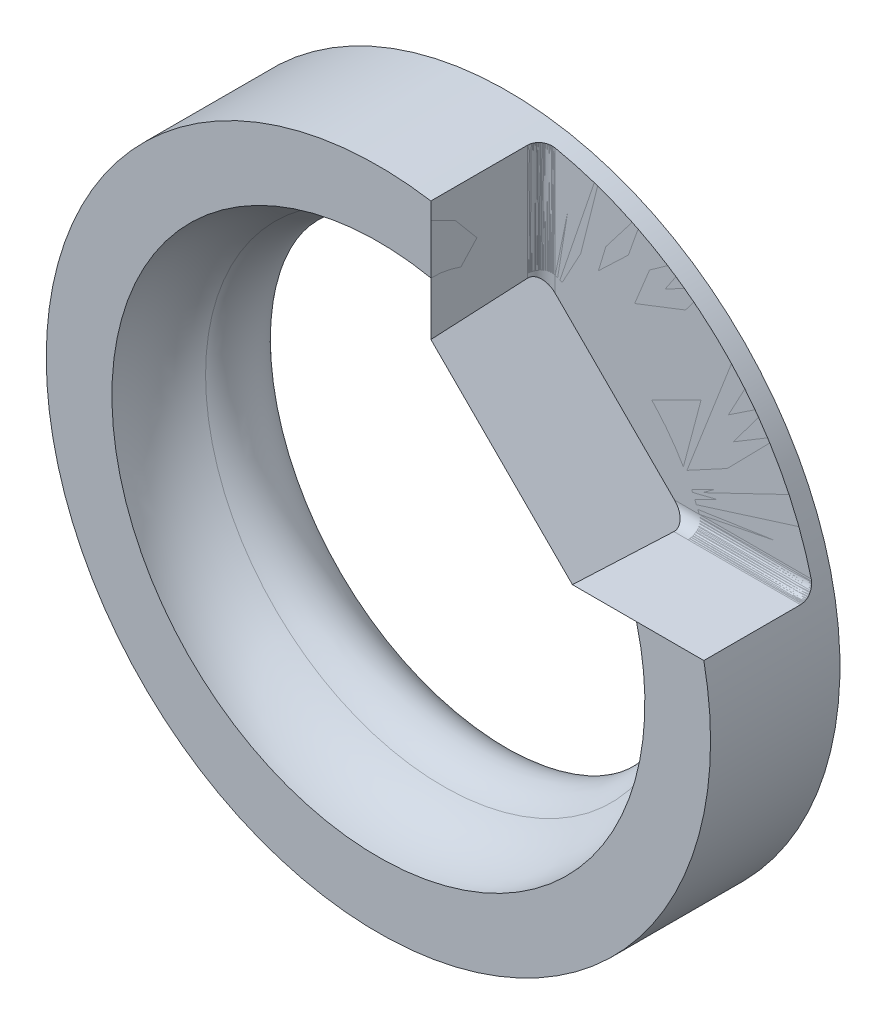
ISO-10303-21;
HEADER;
FILE_DESCRIPTION(('STEP AP214'),'2;1');
FILE_NAME('part.step','',(''),(''),'','','');
FILE_SCHEMA(('AUTOMOTIVE_DESIGN { 1 0 10303 214 1 1 1 1 }'));
ENDSEC;
DATA;
#1=APPLICATION_CONTEXT('core data for automotive mechanical design processes');
#2=APPLICATION_PROTOCOL_DEFINITION('international standard','automotive_design',2000,#1);
#3=PRODUCT_CONTEXT('',#1,'mechanical');
#4=PRODUCT('Part','Part','',(#3));
#5=PRODUCT_RELATED_PRODUCT_CATEGORY('part','',(#4));
#6=PRODUCT_DEFINITION_FORMATION('','',#4);
#7=PRODUCT_DEFINITION_CONTEXT('part definition',#1,'design');
#8=PRODUCT_DEFINITION('design','',#6,#7);
#9=PRODUCT_DEFINITION_SHAPE('','',#8);
#10=(LENGTH_UNIT() NAMED_UNIT(*) SI_UNIT(.MILLI.,.METRE.));
#11=(NAMED_UNIT(*) PLANE_ANGLE_UNIT() SI_UNIT($,.RADIAN.));
#12=(NAMED_UNIT(*) SI_UNIT($,.STERADIAN.) SOLID_ANGLE_UNIT());
#13=UNCERTAINTY_MEASURE_WITH_UNIT(LENGTH_MEASURE(1.E-05),#10,'distance_accuracy_value','');
#14=(GEOMETRIC_REPRESENTATION_CONTEXT(3) GLOBAL_UNCERTAINTY_ASSIGNED_CONTEXT((#13)) GLOBAL_UNIT_ASSIGNED_CONTEXT((#10,
#11,#12)) REPRESENTATION_CONTEXT('',''));
#15=CARTESIAN_POINT('',(0.,0.,0.));
#16=DIRECTION('',(0.,0.,1.));
#17=DIRECTION('',(1.,0.,0.));
#18=AXIS2_PLACEMENT_3D('',#15,#16,#17);
#19=CARTESIAN_POINT('',(40.1749745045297,17.4306619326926,7.09912920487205));
#20=DIRECTION('',(-0.706676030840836,-0.706676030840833,-0.0348994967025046));
#21=DIRECTION('',(0.707106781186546,-0.707106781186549,0.));
#22=AXIS2_PLACEMENT_3D('',#19,#20,#21);
#23=PLANE('',#22);
#24=DIRECTION('',(-0.707106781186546,0.707106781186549,0.));
#25=VECTOR('',#24,1.);
#26=CARTESIAN_POINT('',(11.4005940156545,45.1679484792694,28.0991292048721));
#27=LINE('',#26,#25);
#28=CARTESIAN_POINT('',(42.1378805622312,14.4306619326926,28.0991292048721));
#29=VERTEX_POINT('',#28);
#30=CARTESIAN_POINT('',(11.4005940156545,45.1679484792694,28.0991292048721));
#31=VERTEX_POINT('',#30);
#32=EDGE_CURVE('E76',#29,#31,#27,.T.);
#33=ORIENTED_EDGE('',*,*,#32,.T.);
#34=DIRECTION('',(0.,0.0493253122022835,-0.998782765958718));
#35=VECTOR('',#34,1.);
#36=CARTESIAN_POINT('',(11.4005940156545,46.2050424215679,7.09912920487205));
#37=LINE('',#36,#35);
#38=CARTESIAN_POINT('',(11.4005940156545,46.2050424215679,7.09912920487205));
#39=VERTEX_POINT('',#38);
#40=EDGE_CURVE('E93',#31,#39,#37,.T.);
#41=ORIENTED_EDGE('',*,*,#40,.T.);
#42=CARTESIAN_POINT('',(14.4005940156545,43.2050424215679,7.09912920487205));
#43=DIRECTION('',(-0.706676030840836,-0.706676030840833,-0.0348994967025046));
#44=DIRECTION('',(-0.705815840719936,0.707537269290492,-0.0348570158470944));
#45=AXIS2_PLACEMENT_3D('',#42,#43,#44);
#46=ELLIPSE('',#45,4.24522676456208,3.);
#47=CARTESIAN_POINT('',(14.4005940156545,43.3531986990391,4.09912920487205));
#48=VERTEX_POINT('',#47);
#49=EDGE_CURVE('E98',#39,#48,#46,.T.);
#50=ORIENTED_EDGE('',*,*,#49,.T.);
#51=DIRECTION('',(0.707106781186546,-0.707106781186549,0.));
#52=VECTOR('',#51,1.);
#53=CARTESIAN_POINT('',(40.3231307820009,17.4306619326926,4.09912920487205));
#54=LINE('',#53,#52);
#55=CARTESIAN_POINT('',(40.3231307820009,17.4306619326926,4.09912920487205));
#56=VERTEX_POINT('',#55);
#57=EDGE_CURVE('E103',#48,#56,#54,.T.);
#58=ORIENTED_EDGE('',*,*,#57,.T.);
#59=CARTESIAN_POINT('',(40.1749745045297,17.4306619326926,7.09912920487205));
#60=DIRECTION('',(-0.706676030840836,-0.706676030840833,-0.0348994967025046));
#61=DIRECTION('',(-0.707537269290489,0.705815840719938,0.0348570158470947));
#62=AXIS2_PLACEMENT_3D('',#59,#60,#61);
#63=ELLIPSE('',#62,4.24522676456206,3.);
#64=CARTESIAN_POINT('',(43.1749745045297,14.4306619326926,7.09912920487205));
#65=VERTEX_POINT('',#64);
#66=EDGE_CURVE('E72',#56,#65,#63,.T.);
#67=ORIENTED_EDGE('',*,*,#66,.T.);
#68=DIRECTION('',(-0.0493253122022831,0.,0.998782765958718));
#69=VECTOR('',#68,1.);
#70=CARTESIAN_POINT('',(42.1378805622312,14.4306619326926,28.0991292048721));
#71=LINE('',#70,#69);
#72=EDGE_CURVE('E13',#65,#29,#71,.T.);
#73=ORIENTED_EDGE('',*,*,#72,.T.);
#74=EDGE_LOOP('',(#33,#41,#50,#58,#67,#73));
#75=FACE_BOUND('',#74,.T.);
#76=ADVANCED_FACE('F67',(#75),#23,.T.);
#77=OPEN_SHELL('',(#76));
#78=SHELL_BASED_SURFACE_MODEL('B2',(#77));
#79=CARTESIAN_POINT('',(11.4005940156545,14.4306619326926,4.09912920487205));
#80=DIRECTION('',(-1.,0.,0.));
#81=DIRECTION('',(0.,0.,1.));
#82=AXIS2_PLACEMENT_3D('',#79,#80,#81);
#83=PLANE('',#82);
#84=DIRECTION('',(0.,1.,0.));
#85=VECTOR('',#84,1.);
#86=CARTESIAN_POINT('',(11.4005940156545,76.9827025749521,7.09912920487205));
#87=LINE('',#86,#85);
#88=CARTESIAN_POINT('',(11.4005940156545,71.2284769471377,7.09912920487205));
#89=VERTEX_POINT('',#88);
#90=CARTESIAN_POINT('',(11.4005940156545,46.2050424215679,7.09912920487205));
#91=VERTEX_POINT('',#90);
#92=EDGE_CURVE('E265',#89,#91,#87,.F.);
#93=ORIENTED_EDGE('',*,*,#92,.T.);
#94=DIRECTION('',(0.,-0.0493253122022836,0.998782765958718));
#95=VECTOR('',#94,1.);
#96=CARTESIAN_POINT('',(11.4005940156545,46.2755316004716,5.6718016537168));
#97=LINE('',#96,#95);
#98=CARTESIAN_POINT('',(11.4005940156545,45.1679484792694,28.0991292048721));
#99=VERTEX_POINT('',#98);
#100=EDGE_CURVE('E65',#91,#99,#97,.T.);
#101=ORIENTED_EDGE('',*,*,#100,.T.);
#102=DIRECTION('',(0.,-1.,0.));
#103=VECTOR('',#102,1.);
#104=CARTESIAN_POINT('',(11.4005940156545,14.4306619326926,28.0991292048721));
#105=LINE('',#104,#103);
#106=CARTESIAN_POINT('',(11.4005940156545,71.2284769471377,28.0991292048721));
#107=VERTEX_POINT('',#106);
#108=EDGE_CURVE('E254',#107,#99,#105,.T.);
#109=ORIENTED_EDGE('',*,*,#108,.F.);
#110=DIRECTION('',(0.,0.,1.));
#111=VECTOR('',#110,1.);
#112=CARTESIAN_POINT('',(11.4005940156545,71.2284769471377,4.09912920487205));
#113=LINE('',#112,#111);
#114=EDGE_CURVE('E245',#89,#107,#113,.T.);
#115=ORIENTED_EDGE('',*,*,#114,.F.);
#116=EDGE_LOOP('',(#93,#101,#109,#115));
#117=FACE_BOUND('',#116,.T.);
#118=ADVANCED_FACE('F138',(#117),#83,.T.);
#119=CARTESIAN_POINT('',(14.4005940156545,76.9827025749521,7.09912920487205));
#120=DIRECTION('',(0.,1.,0.));
#121=DIRECTION('',(0.,0.,1.));
#122=AXIS2_PLACEMENT_3D('',#119,#120,#121);
#123=CYLINDRICAL_SURFACE('',#122,3.);
#124=DIRECTION('',(0.,1.,0.));
#125=VECTOR('',#124,1.);
#126=CARTESIAN_POINT('',(14.4005940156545,76.9827025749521,4.09912920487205));
#127=LINE('',#126,#125);
#128=CARTESIAN_POINT('',(14.4005940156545,70.6830415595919,4.09912920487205));
#129=VERTEX_POINT('',#128);
#130=CARTESIAN_POINT('',(14.4005940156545,43.3531986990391,4.09912920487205));
#131=VERTEX_POINT('',#130);
#132=EDGE_CURVE('E261',#129,#131,#127,.F.);
#133=ORIENTED_EDGE('',*,*,#132,.T.);
#134=CARTESIAN_POINT('',(14.4005940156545,43.2050424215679,7.09912920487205));
#135=DIRECTION('',(-0.706676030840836,-0.706676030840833,-0.0348994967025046));
#136=DIRECTION('',(-0.705815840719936,0.707537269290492,-0.0348570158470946));
#137=AXIS2_PLACEMENT_3D('',#134,#135,#136);
#138=ELLIPSE('',#137,4.24522676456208,3.);
#139=EDGE_CURVE('E144',#131,#91,#138,.F.);
#140=ORIENTED_EDGE('',*,*,#139,.T.);
#141=ORIENTED_EDGE('',*,*,#92,.F.);
#142=CARTESIAN_POINT('',(11.4005940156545,71.2284769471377,7.09912920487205));
#143=CARTESIAN_POINT('',(11.4005929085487,71.2284768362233,7.05052162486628));
#144=CARTESIAN_POINT('',(11.4017753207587,71.2282838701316,7.00191416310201));
#145=CARTESIAN_POINT('',(11.4065042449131,71.2275138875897,6.90471412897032));
#146=CARTESIAN_POINT('',(11.4100557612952,71.2269360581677,6.85612180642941));
#147=CARTESIAN_POINT('',(11.41953020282,71.2253963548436,6.75906819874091));
#148=CARTESIAN_POINT('',(11.4254582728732,71.2244336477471,6.71060742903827));
#149=CARTESIAN_POINT('',(11.4396857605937,71.2221242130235,6.61393382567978));
#150=CARTESIAN_POINT('',(11.4479904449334,71.220776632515,6.56572178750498));
#151=CARTESIAN_POINT('',(11.4669657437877,71.2176974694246,6.46966315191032));
#152=CARTESIAN_POINT('',(11.4776417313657,71.2159650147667,6.42181764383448));
#153=CARTESIAN_POINT('',(11.5013482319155,71.2121161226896,6.32660985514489));
#154=CARTESIAN_POINT('',(11.5143842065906,71.2099987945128,6.27924897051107));
#155=CARTESIAN_POINT('',(11.5427933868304,71.2053801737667,6.18512821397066));
#156=CARTESIAN_POINT('',(11.5581721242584,71.2028779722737,6.13837005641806));
#157=CARTESIAN_POINT('',(11.5912435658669,71.197489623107,6.04557223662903));
#158=CARTESIAN_POINT('',(11.6089418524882,71.1946025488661,5.99953461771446));
#159=CARTESIAN_POINT('',(11.646623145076,71.1884444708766,5.90829475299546));
#160=CARTESIAN_POINT('',(11.6666117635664,71.1851725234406,5.86309488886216));
#161=CARTESIAN_POINT('',(11.7088384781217,71.1782447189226,5.77364649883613));
#162=CARTESIAN_POINT('',(11.7310821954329,71.1745879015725,5.72940070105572));
#163=CARTESIAN_POINT('',(11.7777778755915,71.1668903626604,5.64197518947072));
#164=CARTESIAN_POINT('',(11.8022354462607,71.1628486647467,5.59879855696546));
#165=CARTESIAN_POINT('',(11.8533116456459,71.1543814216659,5.51362457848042));
#166=CARTESIAN_POINT('',(11.8799358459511,71.1499548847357,5.47163067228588));
#167=CARTESIAN_POINT('',(11.9352921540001,71.1407178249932,5.38893353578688));
#168=CARTESIAN_POINT('',(11.9640297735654,71.1359062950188,5.34823410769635));
#169=CARTESIAN_POINT('',(12.0235540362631,71.1258998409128,5.26823502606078));
#170=CARTESIAN_POINT('',(12.0543461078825,71.1207038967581,5.22893953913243));
#171=CARTESIAN_POINT('',(12.1179140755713,71.1099264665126,5.15185544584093));
#172=CARTESIAN_POINT('',(12.150695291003,71.1043439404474,5.11407137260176));
#173=CARTESIAN_POINT('',(12.2181725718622,71.0928014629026,5.04011261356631));
#174=CARTESIAN_POINT('',(12.2528738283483,71.0868404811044,5.00394282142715));
#175=CARTESIAN_POINT('',(12.3179474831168,71.0755772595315,4.93942779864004));
#176=CARTESIAN_POINT('',(12.3480502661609,71.0703357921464,4.91079929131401));
#177=CARTESIAN_POINT('',(12.410135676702,71.0594486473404,4.8541606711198));
#178=CARTESIAN_POINT('',(12.4421461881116,71.0537962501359,4.82618238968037));
#179=CARTESIAN_POINT('',(12.5080715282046,71.0420937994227,4.77098607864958));
#180=CARTESIAN_POINT('',(12.5420135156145,71.0360374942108,4.74380181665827));
#181=CARTESIAN_POINT('',(12.611817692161,71.0235250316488,4.69034185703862));
#182=CARTESIAN_POINT('',(12.6477061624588,71.0170628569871,4.66410187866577));
#183=CARTESIAN_POINT('',(12.7214098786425,71.0037389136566,4.61268491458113));
#184=CARTESIAN_POINT('',(12.7592503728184,70.9968714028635,4.58754560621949));
#185=CARTESIAN_POINT('',(12.8368544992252,70.9827363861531,4.53849011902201));
#186=CARTESIAN_POINT('',(12.876642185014,70.9754633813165,4.51461357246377));
#187=CARTESIAN_POINT('',(12.9581259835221,70.9605171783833,4.46824895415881));
#188=CARTESIAN_POINT('',(12.9998447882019,70.9528387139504,4.44580245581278));
#189=CARTESIAN_POINT('',(13.0851641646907,70.9370813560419,4.40246789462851));
#190=CARTESIAN_POINT('',(13.1287858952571,70.9289974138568,4.38162332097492));
#191=CARTESIAN_POINT('',(13.217871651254,70.9124288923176,4.34166649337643));
#192=CARTESIAN_POINT('',(13.2633551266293,70.9039394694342,4.32259960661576));
#193=CARTESIAN_POINT('',(13.3561112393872,70.8865597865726,4.28637516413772));
#194=CARTESIAN_POINT('',(13.4034014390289,70.8776648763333,4.26926480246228));
#195=CARTESIAN_POINT('',(13.4997033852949,70.8594740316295,4.23713264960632));
#196=CARTESIAN_POINT('',(13.5487306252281,70.8501736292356,4.22215981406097));
#197=CARTESIAN_POINT('',(13.648423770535,70.8311716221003,4.19448315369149));
#198=CARTESIAN_POINT('',(13.699102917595,70.821465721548,4.18182996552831));
#199=CARTESIAN_POINT('',(13.8020009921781,70.8016525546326,4.15897316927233));
#200=CARTESIAN_POINT('',(13.8542307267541,70.7915411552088,4.14882178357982));
#201=CARTESIAN_POINT('',(13.9601144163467,70.7709168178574,4.13114784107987));
#202=CARTESIAN_POINT('',(14.0137765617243,70.7603999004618,4.12367897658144));
#203=CARTESIAN_POINT('',(14.122392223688,70.7389644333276,4.11154745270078));
#204=CARTESIAN_POINT('',(14.17735113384,70.7280420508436,4.10693983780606));
#205=CARTESIAN_POINT('',(14.2884097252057,70.7057952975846,4.10070176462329));
#206=CARTESIAN_POINT('',(14.3445118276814,70.694467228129,4.09912751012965));
#207=CARTESIAN_POINT('',(14.4005940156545,70.6830415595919,4.09912920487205));
#208=B_SPLINE_CURVE_WITH_KNOTS('',3,(#142,#143,#144,#145,#146,#147,#148,#149,#150,#151,#152,
#153,#154,#155,#156,#157,#158,#159,#160,#161,#162,#163,#164,#165,#166,#167,#168,#169,#170,#171,
#172,#173,#174,#175,#176,#177,#178,#179,#180,#181,#182,#183,#184,#185,#186,#187,#188,#189,#190,
#191,#192,#193,#194,#195,#196,#197,#198,#199,#200,#201,#202,#203,#204,#205,#206,#207),
.UNSPECIFIED.,.F.,.F.,(4,2,2,2,2,2,2,2,2,2,2,2,2,2,2,2,2,2,2,2,2,2,2,2,2,2,2,2,2,2,2,2,4),(0.,
0.145807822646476,0.291924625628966,0.4383594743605,0.58512137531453,0.732219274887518,
0.879662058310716,1.0274585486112,1.17561750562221,1.3241476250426,1.4730575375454,
1.62235580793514,1.77205093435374,1.92215134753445,2.07266541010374,2.22360141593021,
2.37496758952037,2.5005478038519,2.62917333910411,2.76084942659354,2.89558093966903,
3.03337242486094,3.1742281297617,3.31815202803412,3.46514784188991,3.61521906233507,
3.7683689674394,3.92460063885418,4.08391697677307,4.24632071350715,4.41181442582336,
4.58040054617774,4.75208137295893),.UNSPECIFIED.);
#209=EDGE_CURVE('E267',#129,#89,#208,.F.);
#210=ORIENTED_EDGE('',*,*,#209,.F.);
#211=EDGE_LOOP('',(#133,#140,#141,#210));
#212=FACE_BOUND('',#211,.T.);
#213=ADVANCED_FACE('F237',(#212),#123,.T.);
#214=CARTESIAN_POINT('',(11.4005940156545,76.9827025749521,4.09912920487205));
#215=DIRECTION('',(0.,0.,-1.));
#216=DIRECTION('',(-1.,0.,0.));
#217=AXIS2_PLACEMENT_3D('',#214,#215,#216);
#218=PLANE('',#217);
#219=DIRECTION('',(-1.,0.,0.));
#220=VECTOR('',#219,1.);
#221=CARTESIAN_POINT('',(11.4005940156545,17.4306619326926,4.09912920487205));
#222=LINE('',#221,#220);
#223=CARTESIAN_POINT('',(69.9974392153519,17.4306619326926,4.09912920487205));
#224=VERTEX_POINT('',#223);
#225=CARTESIAN_POINT('',(40.3231307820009,17.4306619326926,4.09912920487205));
#226=VERTEX_POINT('',#225);
#227=EDGE_CURVE('E199',#224,#226,#222,.T.);
#228=ORIENTED_EDGE('',*,*,#227,.T.);
#229=DIRECTION('',(-0.707106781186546,0.707106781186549,0.));
#230=VECTOR('',#229,1.);
#231=CARTESIAN_POINT('',(-3.91415792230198,61.6679506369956,4.09912920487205));
#232=LINE('',#231,#230);
#233=EDGE_CURVE('E276',#226,#131,#232,.T.);
#234=ORIENTED_EDGE('',*,*,#233,.T.);
#235=ORIENTED_EDGE('',*,*,#132,.F.);
#236=CARTESIAN_POINT('',(14.4005940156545,70.6830415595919,4.09912920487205));
#237=CARTESIAN_POINT('',(19.2088286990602,69.7033621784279,4.09912920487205));
#238=CARTESIAN_POINT('',(23.838646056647,68.0822181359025,4.09912920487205));
#239=CARTESIAN_POINT('',(28.6104355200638,66.4113621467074,4.09912920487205));
#240=CARTESIAN_POINT('',(33.101613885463,64.0917516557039,4.09912920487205));
#241=CARTESIAN_POINT('',(37.6866103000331,61.7236858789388,4.09912920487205));
#242=CARTESIAN_POINT('',(41.8870104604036,58.727743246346,4.09912920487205));
#243=CARTESIAN_POINT('',(46.1321660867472,55.6998787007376,4.09912920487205));
#244=CARTESIAN_POINT('',(49.8970037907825,52.0937470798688,4.09912920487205));
#245=CARTESIAN_POINT('',(53.6626117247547,48.486877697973,4.09912920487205));
#246=CARTESIAN_POINT('',(56.869736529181,44.3768243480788,4.09912920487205));
#247=CARTESIAN_POINT('',(60.0443481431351,40.3084378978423,4.09912920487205));
#248=CARTESIAN_POINT('',(62.6070460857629,35.8305351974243,4.09912920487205));
#249=CARTESIAN_POINT('',(65.1183335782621,31.4424639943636,4.09912920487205));
#250=CARTESIAN_POINT('',(66.9926504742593,26.7479766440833,4.09912920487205));
#251=CARTESIAN_POINT('',(68.8117626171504,22.1917572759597,4.09912920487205));
#252=CARTESIAN_POINT('',(69.9974392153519,17.4306619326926,4.09912920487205));
#253=B_SPLINE_CURVE_WITH_KNOTS('',2,(#236,#237,#238,#239,#240,#241,#242,#243,#244,#245,#246,
#247,#248,#249,#250,#251,#252),.UNSPECIFIED.,.F.,.F.,(3,2,2,2,2,2,2,2,3),(0.,0.125,0.25,0.375,
0.5,0.625,0.75,0.875,1.),.UNSPECIFIED.);
#254=EDGE_CURVE('E221',#224,#129,#253,.F.);
#255=ORIENTED_EDGE('',*,*,#254,.F.);
#256=EDGE_LOOP('',(#228,#234,#235,#255));
#257=FACE_BOUND('',#256,.T.);
#258=ADVANCED_FACE('F228',(#257),#218,.T.);
#259=CARTESIAN_POINT('',(11.4005940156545,17.4306619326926,7.09912920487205));
#260=DIRECTION('',(-1.,0.,0.));
#261=DIRECTION('',(0.,0.,1.));
#262=AXIS2_PLACEMENT_3D('',#259,#260,#261);
#263=CYLINDRICAL_SURFACE('',#262,3.);
#264=DIRECTION('',(1.,0.,0.));
#265=VECTOR('',#264,1.);
#266=CARTESIAN_POINT('',(11.4005940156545,14.4306619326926,7.09912920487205));
#267=LINE('',#266,#265);
#268=CARTESIAN_POINT('',(70.6769090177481,14.4306619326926,7.09912920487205));
#269=VERTEX_POINT('',#268);
#270=CARTESIAN_POINT('',(43.1749745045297,14.4306619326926,7.09912920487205));
#271=VERTEX_POINT('',#270);
#272=EDGE_CURVE('E191',#269,#271,#267,.F.);
#273=ORIENTED_EDGE('',*,*,#272,.T.);
#274=CARTESIAN_POINT('',(40.1749745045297,17.4306619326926,7.09912920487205));
#275=DIRECTION('',(-0.706676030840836,-0.706676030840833,-0.0348994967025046));
#276=DIRECTION('',(-0.707537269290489,0.705815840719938,0.0348570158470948));
#277=AXIS2_PLACEMENT_3D('',#274,#275,#276);
#278=ELLIPSE('',#277,4.24522676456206,3.);
#279=EDGE_CURVE('E273',#271,#226,#278,.F.);
#280=ORIENTED_EDGE('',*,*,#279,.T.);
#281=ORIENTED_EDGE('',*,*,#227,.F.);
#282=CARTESIAN_POINT('',(69.9974392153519,17.4306619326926,4.09912920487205));
#283=CARTESIAN_POINT('',(70.0064558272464,17.3944528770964,4.09912892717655));
#284=CARTESIAN_POINT('',(70.0154352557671,17.3582345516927,4.09978474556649));
#285=CARTESIAN_POINT('',(70.0331369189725,17.2865460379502,4.10238247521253));
#286=CARTESIAN_POINT('',(70.0418607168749,17.2510752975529,4.10429854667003));
#287=CARTESIAN_POINT('',(70.059051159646,17.1809235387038,4.10933952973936));
#288=CARTESIAN_POINT('',(70.0675194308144,17.1462410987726,4.1124391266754));
#289=CARTESIAN_POINT('',(70.0841987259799,17.0777022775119,4.11976978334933));
#290=CARTESIAN_POINT('',(70.0924114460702,17.0438436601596,4.12397608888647));
#291=CARTESIAN_POINT('',(70.1085795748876,16.9769838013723,4.13344346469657));
#292=CARTESIAN_POINT('',(70.11653675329,16.9439795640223,4.13868036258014));
#293=CARTESIAN_POINT('',(70.132193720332,16.8788550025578,4.15013302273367));
#294=CARTESIAN_POINT('',(70.1398953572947,16.8467309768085,4.15632521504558));
#295=CARTESIAN_POINT('',(70.155041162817,16.7833888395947,4.16961362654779));
#296=CARTESIAN_POINT('',(70.1624872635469,16.7521663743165,4.17668689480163));
#297=CARTESIAN_POINT('',(70.1771219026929,16.6906450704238,4.19166387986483));
#298=CARTESIAN_POINT('',(70.1843124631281,16.6603412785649,4.19954527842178));
#299=CARTESIAN_POINT('',(70.1984359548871,16.6006709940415,4.21606639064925));
#300=CARTESIAN_POINT('',(70.2053710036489,16.5712990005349,4.22468442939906));
#301=CARTESIAN_POINT('',(70.218983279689,16.5135021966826,4.24260829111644));
#302=CARTESIAN_POINT('',(70.225662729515,16.4850713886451,4.25189309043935));
#303=CARTESIAN_POINT('',(70.2387640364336,16.4291632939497,4.27108169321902));
#304=CARTESIAN_POINT('',(70.2451882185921,16.4016795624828,4.28096512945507));
#305=CARTESIAN_POINT('',(70.2577776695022,16.3476686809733,4.30128406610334));
#306=CARTESIAN_POINT('',(70.2639454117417,16.3211346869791,4.31169985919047));
#307=CARTESIAN_POINT('',(70.2774658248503,16.2628132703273,4.33555911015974));
#308=CARTESIAN_POINT('',(70.2847953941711,16.2310925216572,4.34917909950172));
#309=CARTESIAN_POINT('',(70.2992237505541,16.1684795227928,4.37735397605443));
#310=CARTESIAN_POINT('',(70.3063242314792,16.1375819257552,4.39189612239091));
#311=CARTESIAN_POINT('',(70.3202931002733,16.0766347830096,4.42186380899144));
#312=CARTESIAN_POINT('',(70.3271632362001,16.0465795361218,4.43727693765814));
#313=CARTESIAN_POINT('',(70.3406717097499,15.9873346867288,4.46893509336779));
#314=CARTESIAN_POINT('',(70.3473118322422,15.9581390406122,4.48516804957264));
#315=CARTESIAN_POINT('',(70.3603601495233,15.9006281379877,4.51841486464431));
#316=CARTESIAN_POINT('',(70.3667701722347,15.872306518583,4.53541699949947));
#317=CARTESIAN_POINT('',(70.3793582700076,15.816555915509,4.57015168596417));
#318=CARTESIAN_POINT('',(70.3855382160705,15.7891202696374,4.58787286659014));
#319=CARTESIAN_POINT('',(70.3976661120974,15.7351513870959,4.62399579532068));
#320=CARTESIAN_POINT('',(70.4036159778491,15.7086112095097,4.64238653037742));
#321=CARTESIAN_POINT('',(70.415283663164,15.6564406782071,4.67979944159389));
#322=CARTESIAN_POINT('',(70.4210034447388,15.6308031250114,4.69881096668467));
#323=CARTESIAN_POINT('',(70.4322109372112,15.5804429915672,4.73741714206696));
#324=CARTESIAN_POINT('',(70.4377006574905,15.5557129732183,4.75700150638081));
#325=CARTESIAN_POINT('',(70.4484478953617,15.5071708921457,4.79670593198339));
#326=CARTESIAN_POINT('',(70.4537074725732,15.4833511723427,4.8168160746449));
#327=CARTESIAN_POINT('',(70.463994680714,15.4366306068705,4.85752558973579));
#328=CARTESIAN_POINT('',(70.4690244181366,15.4137219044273,4.87811541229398));
#329=CARTESIAN_POINT('',(70.4788507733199,15.368822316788,4.91973883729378));
#330=CARTESIAN_POINT('',(70.4836495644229,15.3468233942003,4.94076325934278));
#331=CARTESIAN_POINT('',(70.4935954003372,15.3010855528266,4.9858273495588));
#332=CARTESIAN_POINT('',(70.4987231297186,15.2774194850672,5.00994530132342));
#333=CARTESIAN_POINT('',(70.5087607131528,15.2309613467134,5.05892005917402));
#334=CARTESIAN_POINT('',(70.5136711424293,15.2081669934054,5.08377458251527));
#335=CARTESIAN_POINT('',(70.5232729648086,15.1634731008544,5.1341899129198));
#336=CARTESIAN_POINT('',(70.5279649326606,15.141571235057,5.1597485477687));
#337=CARTESIAN_POINT('',(70.5371301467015,15.0986822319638,5.21153868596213));
#338=CARTESIAN_POINT('',(70.5416039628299,15.077692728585,5.23776812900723));
#339=CARTESIAN_POINT('',(70.5503327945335,15.036647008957,5.29086609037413));
#340=CARTESIAN_POINT('',(70.5545883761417,15.0165883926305,5.3177326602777));
#341=CARTESIAN_POINT('',(70.562880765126,14.9774217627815,5.37207063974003));
#342=CARTESIAN_POINT('',(70.5669181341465,14.9583113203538,5.39954021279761));
#343=CARTESIAN_POINT('',(70.5747740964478,14.9210570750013,5.45504959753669));
#344=CARTESIAN_POINT('',(70.5785932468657,14.9029108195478,5.48308768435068));
#345=CARTESIAN_POINT('',(70.5860127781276,14.8675997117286,5.53969916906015));
#346=CARTESIAN_POINT('',(70.589613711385,14.8504323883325,5.56827095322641));
#347=CARTESIAN_POINT('',(70.5965968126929,14.8170926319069,5.62591462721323));
#348=CARTESIAN_POINT('',(70.5999795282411,14.8009177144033,5.65498501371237));
#349=CARTESIAN_POINT('',(70.6065261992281,14.7695749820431,5.71359045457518));
#350=CARTESIAN_POINT('',(70.609690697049,14.7544046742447,5.74312411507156));
#351=CARTESIAN_POINT('',(70.6158009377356,14.7250821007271,5.80262047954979));
#352=CARTESIAN_POINT('',(70.6187472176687,14.7109273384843,5.83258189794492));
#353=CARTESIAN_POINT('',(70.6244210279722,14.6836455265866,5.89289801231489));
#354=CARTESIAN_POINT('',(70.6271490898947,14.6705159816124,5.92325152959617));
#355=CARTESIAN_POINT('',(70.6323864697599,14.6452930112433,5.98431597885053));
#356=CARTESIAN_POINT('',(70.6348963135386,14.6331970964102,6.01502583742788));
#357=CARTESIAN_POINT('',(70.6396972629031,14.6100485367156,6.07676705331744));
#358=CARTESIAN_POINT('',(70.6419888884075,14.5989934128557,6.10779744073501));
#359=CARTESIAN_POINT('',(70.6463534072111,14.5779323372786,6.17014378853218));
#360=CARTESIAN_POINT('',(70.6484268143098,14.5679239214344,6.20145888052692));
#361=CARTESIAN_POINT('',(70.6523549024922,14.5489609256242,6.26433874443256));
#362=CARTESIAN_POINT('',(70.6542100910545,14.5400039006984,6.29590274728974));
#363=CARTESIAN_POINT('',(70.6577017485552,14.5231471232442,6.35924461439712));
#364=CARTESIAN_POINT('',(70.6593387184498,14.5152449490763,6.39102180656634));
#365=CARTESIAN_POINT('',(70.6623939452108,14.5005000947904,6.45475434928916));
#366=CARTESIAN_POINT('',(70.6638126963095,14.4936550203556,6.48670912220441));
#367=CARTESIAN_POINT('',(70.6664314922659,14.4810253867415,6.55076127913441));
#368=CARTESIAN_POINT('',(70.6676320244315,14.4752384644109,6.58285817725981));
#369=CARTESIAN_POINT('',(70.6698143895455,14.4647249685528,6.64715923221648));
#370=CARTESIAN_POINT('',(70.6707967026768,14.4599960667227,6.67936299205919));
#371=CARTESIAN_POINT('',(70.6725426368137,14.4515972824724,6.74384265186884));
#372=CARTESIAN_POINT('',(70.6733067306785,14.4479251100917,6.77611824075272));
#373=CARTESIAN_POINT('',(70.6746162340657,14.4416372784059,6.84070670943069));
#374=CARTESIAN_POINT('',(70.6751621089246,14.4390193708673,6.87301936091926));
#375=CARTESIAN_POINT('',(70.6760351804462,14.4348365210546,6.93764741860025));
#376=CARTESIAN_POINT('',(70.6763628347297,14.4332693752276,6.96996267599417));
#377=CARTESIAN_POINT('',(70.6767994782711,14.4311830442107,7.03456173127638));
#378=CARTESIAN_POINT('',(70.6769089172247,14.4306617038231,7.06684545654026));
#379=CARTESIAN_POINT('',(70.6769090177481,14.4306619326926,7.09912920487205));
#380=B_SPLINE_CURVE_WITH_KNOTS('',3,(#282,#283,#284,#285,#286,#287,#288,#289,#290,#291,#292,
#293,#294,#295,#296,#297,#298,#299,#300,#301,#302,#303,#304,#305,#306,#307,#308,#309,#310,#311,
#312,#313,#314,#315,#316,#317,#318,#319,#320,#321,#322,#323,#324,#325,#326,#327,#328,#329,#330,
#331,#332,#333,#334,#335,#336,#337,#338,#339,#340,#341,#342,#343,#344,#345,#346,#347,#348,#349,
#350,#351,#352,#353,#354,#355,#356,#357,#358,#359,#360,#361,#362,#363,#364,#365,#366,#367,#368,
#369,#370,#371,#372,#373,#374,#375,#376,#377,#378,#379),.UNSPECIFIED.,.F.,.F.,(4,2,2,2,2,2,2,2,
2,2,2,2,2,2,2,2,2,2,2,2,2,2,2,2,2,2,2,2,2,2,2,2,2,2,2,2,2,2,2,2,2,2,2,2,2,2,2,2,4),(0.,
0.111938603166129,0.221650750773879,0.329136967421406,0.434397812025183,0.537433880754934,
0.638245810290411,0.736834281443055,0.833200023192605,0.927343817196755,1.01926650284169,
1.1089689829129,1.19645222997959,1.30230316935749,1.40692087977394,1.51030728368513,
1.61246437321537,1.71339421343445,1.81309894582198,1.91158079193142,2.00884205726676,
2.10488513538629,2.1997125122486,2.29332677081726,2.38573059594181,2.48824086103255,
2.59046118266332,2.69239531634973,2.7940470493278,2.89542020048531,2.9965186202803,
3.09734619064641,3.19790682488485,3.29820446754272,3.39824309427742,3.49802671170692,
3.59755935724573,3.69684509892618,3.79588803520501,3.89469229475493,3.99326203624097,
4.09160144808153,4.18971474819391,4.28760618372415,4.3852800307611,4.48274059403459,
4.57999220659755,4.67703922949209,4.77388605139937),.UNSPECIFIED.);
#381=EDGE_CURVE('E207',#269,#224,#380,.F.);
#382=ORIENTED_EDGE('',*,*,#381,.F.);
#383=EDGE_LOOP('',(#273,#280,#281,#382));
#384=FACE_BOUND('',#383,.T.);
#385=ADVANCED_FACE('F236',(#384),#263,.T.);
#386=CARTESIAN_POINT('',(11.4005940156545,14.4306619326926,4.09912920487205));
#387=DIRECTION('',(0.,-1.,0.));
#388=DIRECTION('',(0.,0.,-1.));
#389=AXIS2_PLACEMENT_3D('',#386,#387,#388);
#390=PLANE('',#389);
#391=DIRECTION('',(1.,0.,0.));
#392=VECTOR('',#391,1.);
#393=CARTESIAN_POINT('',(11.4005940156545,14.4306619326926,28.0991292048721));
#394=LINE('',#393,#392);
#395=CARTESIAN_POINT('',(42.1378805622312,14.4306619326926,28.0991292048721));
#396=VERTEX_POINT('',#395);
#397=CARTESIAN_POINT('',(70.6769090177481,14.4306619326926,28.0991292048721));
#398=VERTEX_POINT('',#397);
#399=EDGE_CURVE('E186',#396,#398,#394,.T.);
#400=ORIENTED_EDGE('',*,*,#399,.F.);
#401=DIRECTION('',(0.0493253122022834,0.,-0.998782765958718));
#402=VECTOR('',#401,1.);
#403=CARTESIAN_POINT('',(43.2454636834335,14.4306619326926,5.67180165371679));
#404=LINE('',#403,#402);
#405=EDGE_CURVE('E190',#396,#271,#404,.T.);
#406=ORIENTED_EDGE('',*,*,#405,.T.);
#407=ORIENTED_EDGE('',*,*,#272,.F.);
#408=DIRECTION('',(0.,0.,-1.));
#409=VECTOR('',#408,1.);
#410=CARTESIAN_POINT('',(70.6769090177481,14.4306619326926,4.09912920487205));
#411=LINE('',#410,#409);
#412=EDGE_CURVE('E195',#398,#269,#411,.T.);
#413=ORIENTED_EDGE('',*,*,#412,.F.);
#414=EDGE_LOOP('',(#400,#406,#407,#413));
#415=FACE_BOUND('',#414,.T.);
#416=ADVANCED_FACE('F196',(#415),#390,.T.);
#417=OPEN_SHELL('',(#118,#213,#258,#385,#416));
#418=SHELL_BASED_SURFACE_MODEL('B7',(#417));
#419=CARTESIAN_POINT('',(0.,72.1350779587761,0.));
#420=DIRECTION('',(0.,0.,-1.));
#421=DIRECTION('',(-1.,0.,0.));
#422=AXIS2_PLACEMENT_3D('',#419,#420,#421);
#423=PLANE('',#422);
#424=CARTESIAN_POINT('',(0.,0.,0.));
#425=DIRECTION('',(0.,0.,-1.));
#426=DIRECTION('',(-1.,0.,0.));
#427=AXIS2_PLACEMENT_3D('',#424,#425,#426);
#428=CIRCLE('',#427,72.1350779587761);
#429=CARTESIAN_POINT('',(-72.1350779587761,0.,0.));
#430=VERTEX_POINT('',#429);
#431=EDGE_CURVE('E451',#430,#430,#428,.T.);
#432=ORIENTED_EDGE('',*,*,#431,.T.);
#433=EDGE_LOOP('',(#432));
#434=FACE_BOUND('',#433,.T.);
#435=CARTESIAN_POINT('',(0.,0.,0.));
#436=DIRECTION('',(0.,0.,-1.));
#437=DIRECTION('',(-1.,0.,0.));
#438=AXIS2_PLACEMENT_3D('',#435,#436,#437);
#439=CIRCLE('',#438,51.5849685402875);
#440=CARTESIAN_POINT('',(-51.5849685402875,0.,0.));
#441=VERTEX_POINT('',#440);
#442=EDGE_CURVE('E453',#441,#441,#439,.T.);
#443=ORIENTED_EDGE('',*,*,#442,.F.);
#444=EDGE_LOOP('',(#443));
#445=FACE_BOUND('',#444,.T.);
#446=ADVANCED_FACE('F359',(#434,#445),#423,.T.);
#447=CARTESIAN_POINT('',(0.,0.,0.));
#448=DIRECTION('',(0.,0.,-1.));
#449=DIRECTION('',(-1.,0.,0.));
#450=AXIS2_PLACEMENT_3D('',#447,#448,#449);
#451=CYLINDRICAL_SURFACE('',#450,72.1350779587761);
#452=DIRECTION('',(0.,0.,-1.));
#453=VECTOR('',#452,1.);
#454=CARTESIAN_POINT('',(11.4005940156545,71.2284769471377,0.));
#455=LINE('',#454,#453);
#456=CARTESIAN_POINT('',(11.4005940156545,71.2284769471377,7.09912920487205));
#457=VERTEX_POINT('',#456);
#458=CARTESIAN_POINT('',(11.4005940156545,71.2284769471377,28.0991292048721));
#459=VERTEX_POINT('',#458);
#460=EDGE_CURVE('E494',#457,#459,#455,.F.);
#461=ORIENTED_EDGE('',*,*,#460,.F.);
#462=CARTESIAN_POINT('',(11.4005940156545,71.2284769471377,7.09912920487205));
#463=CARTESIAN_POINT('',(11.4005853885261,71.2284772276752,7.01558114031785));
#464=CARTESIAN_POINT('',(11.4040840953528,71.2279183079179,6.93203713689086));
#465=CARTESIAN_POINT('',(11.4180296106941,71.2256847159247,6.76555150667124));
#466=CARTESIAN_POINT('',(11.4284759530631,71.2240101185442,6.68260983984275));
#467=CARTESIAN_POINT('',(11.4562356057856,71.2195501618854,6.51799825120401));
#468=CARTESIAN_POINT('',(11.473541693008,71.2167659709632,6.43632708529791));
#469=CARTESIAN_POINT('',(11.5148708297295,71.2100951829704,6.27477266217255));
#470=CARTESIAN_POINT('',(11.538893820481,71.2062085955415,6.19488938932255));
#471=CARTESIAN_POINT('',(11.6208204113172,71.1929007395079,5.9587052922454));
#472=CARTESIAN_POINT('',(11.6885957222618,71.1818291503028,5.80578720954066));
#473=CARTESIAN_POINT('',(11.848317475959,71.1554168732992,5.51368491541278));
#474=CARTESIAN_POINT('',(11.940261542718,71.1400766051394,5.37449935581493));
#475=CARTESIAN_POINT('',(12.1460727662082,71.1052269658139,5.11294313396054));
#476=CARTESIAN_POINT('',(12.2600376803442,71.0856989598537,4.99065178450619));
#477=CARTESIAN_POINT('',(12.5062634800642,71.0427929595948,4.76692109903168));
#478=CARTESIAN_POINT('',(12.6385278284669,71.0194142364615,4.66548571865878));
#479=CARTESIAN_POINT('',(12.9192165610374,70.9688937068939,4.48499321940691));
#480=CARTESIAN_POINT('',(13.0678187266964,70.9417093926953,4.40622481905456));
#481=CARTESIAN_POINT('',(13.3755655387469,70.8843295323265,4.27471889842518));
#482=CARTESIAN_POINT('',(13.5347071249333,70.8541348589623,4.22197385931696));
#483=CARTESIAN_POINT('',(13.8122122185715,70.8004667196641,4.1549963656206));
#484=CARTESIAN_POINT('',(13.9291139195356,70.7775632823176,4.13404620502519));
#485=CARTESIAN_POINT('',(14.1642172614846,70.730890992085,4.10611362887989));
#486=CARTESIAN_POINT('',(14.2824166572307,70.7071235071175,4.09911003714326));
#487=CARTESIAN_POINT('',(14.4005940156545,70.6830415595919,4.09912920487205));
#488=B_SPLINE_CURVE_WITH_KNOTS('',3,(#462,#463,#464,#465,#466,#467,#468,#469,#470,#471,#472,
#473,#474,#475,#476,#477,#478,#479,#480,#481,#482,#483,#484,#485,#486,#487),.UNSPECIFIED.,.F.,
.F.,(4,2,2,2,2,2,2,2,2,2,2,2,4),(0.,0.250561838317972,0.501106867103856,0.751388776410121,
1.00166849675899,1.50197852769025,2.00223939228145,2.50477432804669,3.00740448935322,
3.51617899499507,4.02480641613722,4.38688865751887,4.7484207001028),.UNSPECIFIED.);
#489=CARTESIAN_POINT('',(14.4005940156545,70.6830415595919,4.09912920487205));
#490=VERTEX_POINT('',#489);
#491=EDGE_CURVE('E136',#457,#490,#488,.T.);
#492=ORIENTED_EDGE('',*,*,#491,.T.);
#493=CARTESIAN_POINT('',(0.,0.,4.09912920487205));
#494=DIRECTION('',(0.,0.,-1.));
#495=DIRECTION('',(-1.,0.,0.));
#496=AXIS2_PLACEMENT_3D('',#493,#494,#495);
#497=CIRCLE('',#496,72.1350779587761);
#498=CARTESIAN_POINT('',(69.9974392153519,17.4306619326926,4.09912920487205));
#499=VERTEX_POINT('',#498);
#500=EDGE_CURVE('E434',#499,#490,#497,.F.);
#501=ORIENTED_EDGE('',*,*,#500,.F.);
#502=CARTESIAN_POINT('',(69.9974392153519,17.4306619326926,4.09912920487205));
#503=CARTESIAN_POINT('',(70.0187725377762,17.3449987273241,4.09912240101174));
#504=CARTESIAN_POINT('',(70.039945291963,17.2592969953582,4.10279840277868));
#505=CARTESIAN_POINT('',(70.0818342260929,17.0884073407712,4.11748418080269));
#506=CARTESIAN_POINT('',(70.1025503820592,17.0032194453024,4.12849434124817));
#507=CARTESIAN_POINT('',(70.1433933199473,16.8339371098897,4.15782011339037));
#508=CARTESIAN_POINT('',(70.1635199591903,16.7498429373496,4.17613747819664));
#509=CARTESIAN_POINT('',(70.2030446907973,16.5834049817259,4.21996754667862));
#510=CARTESIAN_POINT('',(70.222442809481,16.5010611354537,4.24547999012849));
#511=CARTESIAN_POINT('',(70.279403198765,16.2573879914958,4.33269810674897));
#512=CARTESIAN_POINT('',(70.3157271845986,16.0994350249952,4.40508146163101));
#513=CARTESIAN_POINT('',(70.3840994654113,15.797848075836,4.57642869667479));
#514=CARTESIAN_POINT('',(70.4161499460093,15.6542067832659,4.6753789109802));
#515=CARTESIAN_POINT('',(70.4748064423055,15.3879629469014,4.89534544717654));
#516=CARTESIAN_POINT('',(70.5014975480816,15.2650375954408,5.01594750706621));
#517=CARTESIAN_POINT('',(70.5495958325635,15.041181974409,5.27705484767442));
#518=CARTESIAN_POINT('',(70.5710021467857,14.9402553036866,5.41756337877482));
#519=CARTESIAN_POINT('',(70.6076895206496,14.7658873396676,5.71082164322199));
#520=CARTESIAN_POINT('',(70.6231043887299,14.6918483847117,5.86319987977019));
#521=CARTESIAN_POINT('',(70.6482614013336,14.5703985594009,6.17859435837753));
#522=CARTESIAN_POINT('',(70.6580086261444,14.5229638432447,6.34160092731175));
#523=CARTESIAN_POINT('',(70.6688683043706,14.470000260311,6.6047843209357));
#524=CARTESIAN_POINT('',(70.6718842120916,14.4552557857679,6.70312212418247));
#525=CARTESIAN_POINT('',(70.6759028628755,14.4355901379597,6.90066748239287));
#526=CARTESIAN_POINT('',(70.6769085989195,14.4306543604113,6.99987352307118));
#527=CARTESIAN_POINT('',(70.6769090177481,14.4306619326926,7.09912920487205));
#528=B_SPLINE_CURVE_WITH_KNOTS('',3,(#502,#503,#504,#505,#506,#507,#508,#509,#510,#511,#512,
#513,#514,#515,#516,#517,#518,#519,#520,#521,#522,#523,#524,#525,#526,#527),.UNSPECIFIED.,.F.,
.F.,(4,2,2,2,2,2,2,2,2,2,2,2,4),(0.,0.264758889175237,0.529531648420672,0.794367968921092,
1.05919471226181,1.58890361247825,2.1183405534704,2.63855795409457,3.15886039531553,
3.66676406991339,4.17421177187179,4.47219783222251,4.76973988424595),.UNSPECIFIED.);
#529=CARTESIAN_POINT('',(70.6769090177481,14.4306619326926,7.09912920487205));
#530=VERTEX_POINT('',#529);
#531=EDGE_CURVE('E514',#499,#530,#528,.T.);
#532=ORIENTED_EDGE('',*,*,#531,.T.);
#533=DIRECTION('',(0.,0.,-1.));
#534=VECTOR('',#533,1.);
#535=CARTESIAN_POINT('',(70.6769090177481,14.4306619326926,0.));
#536=LINE('',#535,#534);
#537=CARTESIAN_POINT('',(70.6769090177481,14.4306619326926,28.0991292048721));
#538=VERTEX_POINT('',#537);
#539=EDGE_CURVE('E433',#538,#530,#536,.T.);
#540=ORIENTED_EDGE('',*,*,#539,.F.);
#541=CARTESIAN_POINT('',(0.,0.,28.0991292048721));
#542=DIRECTION('',(0.,0.,-1.));
#543=DIRECTION('',(-1.,0.,0.));
#544=AXIS2_PLACEMENT_3D('',#541,#542,#543);
#545=CIRCLE('',#544,72.1350779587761);
#546=EDGE_CURVE('E443',#538,#459,#545,.T.);
#547=ORIENTED_EDGE('',*,*,#546,.T.);
#548=EDGE_LOOP('',(#461,#492,#501,#532,#540,#547));
#549=FACE_BOUND('',#548,.T.);
#550=ORIENTED_EDGE('',*,*,#431,.F.);
#551=EDGE_LOOP('',(#550));
#552=FACE_BOUND('',#551,.T.);
#553=ADVANCED_FACE('F500',(#549,#552),#451,.T.);
#554=CARTESIAN_POINT('',(0.,72.1350779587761,28.0991292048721));
#555=DIRECTION('',(0.,0.,1.));
#556=DIRECTION('',(1.,0.,0.));
#557=AXIS2_PLACEMENT_3D('',#554,#555,#556);
#558=PLANE('',#557);
#559=DIRECTION('',(0.,-1.,0.));
#560=VECTOR('',#559,1.);
#561=CARTESIAN_POINT('',(11.4005940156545,14.4306619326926,28.0991292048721));
#562=LINE('',#561,#560);
#563=CARTESIAN_POINT('',(11.4005940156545,56.7418435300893,28.0991292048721));
#564=VERTEX_POINT('',#563);
#565=EDGE_CURVE('E444',#459,#564,#562,.T.);
#566=ORIENTED_EDGE('',*,*,#565,.F.);
#567=ORIENTED_EDGE('',*,*,#546,.F.);
#568=DIRECTION('',(1.,0.,0.));
#569=VECTOR('',#568,1.);
#570=CARTESIAN_POINT('',(11.4005940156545,14.4306619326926,28.0991292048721));
#571=LINE('',#570,#569);
#572=CARTESIAN_POINT('',(56.0478933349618,14.4306619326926,28.0991292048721));
#573=VERTEX_POINT('',#572);
#574=EDGE_CURVE('E425',#573,#538,#571,.T.);
#575=ORIENTED_EDGE('',*,*,#574,.F.);
#576=CARTESIAN_POINT('',(0.,0.,28.0991292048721));
#577=DIRECTION('',(0.,0.,-1.));
#578=DIRECTION('',(-1.,0.,0.));
#579=AXIS2_PLACEMENT_3D('',#576,#577,#578);
#580=CIRCLE('',#579,57.8758183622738);
#581=EDGE_CURVE('E441',#573,#564,#580,.T.);
#582=ORIENTED_EDGE('',*,*,#581,.T.);
#583=EDGE_LOOP('',(#566,#567,#575,#582));
#584=FACE_BOUND('',#583,.T.);
#585=ADVANCED_FACE('F440',(#584),#558,.T.);
#586=CARTESIAN_POINT('',(0.,0.,28.0991292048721));
#587=DIRECTION('',(0.,0.,-1.));
#588=DIRECTION('',(-1.,0.,0.));
#589=AXIS2_PLACEMENT_3D('',#586,#587,#588);
#590=TOROIDAL_SURFACE('',#589,39.0417129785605,18.8341053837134);
#591=CARTESIAN_POINT('',(11.4005940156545,18.6170784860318,20.4508332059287));
#592=CARTESIAN_POINT('',(11.4005940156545,18.4040731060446,20.8596107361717));
#593=CARTESIAN_POINT('',(11.4005940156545,18.2063687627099,21.276358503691));
#594=CARTESIAN_POINT('',(11.4005940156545,17.8441346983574,22.123835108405));
#595=CARTESIAN_POINT('',(11.4005940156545,17.6795882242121,22.5545567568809));
#596=CARTESIAN_POINT('',(11.4005940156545,17.3861022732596,23.4277962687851));
#597=CARTESIAN_POINT('',(11.4005940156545,17.2571473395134,23.8703089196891));
#598=CARTESIAN_POINT('',(11.4005940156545,17.0370223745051,24.7646715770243));
#599=CARTESIAN_POINT('',(11.4005940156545,16.9458522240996,25.2165215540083));
#600=CARTESIAN_POINT('',(11.4005940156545,16.8028079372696,26.1284350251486));
#601=CARTESIAN_POINT('',(11.4005940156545,16.7511056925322,26.5885256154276));
#602=CARTESIAN_POINT('',(11.4005940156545,16.6887838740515,27.5114920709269));
#603=CARTESIAN_POINT('',(11.4005940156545,16.6781640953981,27.9743679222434));
#604=CARTESIAN_POINT('',(11.4005940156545,16.6982478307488,28.899236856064));
#605=CARTESIAN_POINT('',(11.4005940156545,16.7289531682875,29.3612298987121));
#606=CARTESIAN_POINT('',(11.4005940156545,16.8310022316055,30.2806846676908));
#607=CARTESIAN_POINT('',(11.4005940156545,16.9023455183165,30.7381464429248));
#608=CARTESIAN_POINT('',(11.4005940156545,17.0797619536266,31.6232685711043));
#609=CARTESIAN_POINT('',(11.4005940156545,17.1839913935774,32.0513011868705));
#610=CARTESIAN_POINT('',(11.4005940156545,17.4260775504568,32.8977033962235));
#611=CARTESIAN_POINT('',(11.4005940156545,17.5639330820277,33.3160733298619));
#612=CARTESIAN_POINT('',(11.4005940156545,17.8712140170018,34.1410977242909));
#613=CARTESIAN_POINT('',(11.4005940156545,18.0406447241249,34.5477502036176));
#614=CARTESIAN_POINT('',(11.4005940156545,18.4089454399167,35.3476692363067));
#615=CARTESIAN_POINT('',(11.4005940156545,18.6078282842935,35.7409298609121));
#616=CARTESIAN_POINT('',(11.4005940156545,19.0534772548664,36.5499218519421));
#617=CARTESIAN_POINT('',(11.4005940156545,19.3030181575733,36.9641246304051));
#618=CARTESIAN_POINT('',(11.4005940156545,19.8321950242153,37.7728611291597));
#619=CARTESIAN_POINT('',(11.4005940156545,20.1118350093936,38.1673922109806));
#620=CARTESIAN_POINT('',(11.4005940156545,20.6987876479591,38.9354670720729));
#621=CARTESIAN_POINT('',(11.4005940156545,21.0061086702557,39.3090044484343));
#622=CARTESIAN_POINT('',(11.4005940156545,21.6460719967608,40.0337116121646));
#623=CARTESIAN_POINT('',(11.4005940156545,21.9787157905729,40.3848800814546));
#624=CARTESIAN_POINT('',(11.4005940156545,22.7233989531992,41.1190383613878));
#625=CARTESIAN_POINT('',(11.4005940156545,23.1395393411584,41.4978778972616));
#626=CARTESIAN_POINT('',(11.4005940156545,24.0001519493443,42.2218779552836));
#627=CARTESIAN_POINT('',(11.4005940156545,24.4446259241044,42.5670363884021));
#628=CARTESIAN_POINT('',(11.4005940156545,25.3592509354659,43.2220950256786));
#629=CARTESIAN_POINT('',(11.4005940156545,25.8294174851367,43.5319735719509));
#630=CARTESIAN_POINT('',(11.4005940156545,26.7920916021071,44.1143555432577));
#631=CARTESIAN_POINT('',(11.4005940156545,27.2845904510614,44.3868733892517));
#632=CARTESIAN_POINT('',(11.4005940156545,28.3307651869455,44.9139089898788));
#633=CARTESIAN_POINT('',(11.4005940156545,28.8861329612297,45.1650770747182));
#634=CARTESIAN_POINT('',(11.4005940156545,30.0160986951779,45.6197153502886));
#635=CARTESIAN_POINT('',(11.4005940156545,30.5906978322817,45.8231826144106));
#636=CARTESIAN_POINT('',(11.4005940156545,31.7551545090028,46.180505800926));
#637=CARTESIAN_POINT('',(11.4005940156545,32.3450124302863,46.3343604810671));
#638=CARTESIAN_POINT('',(11.4005940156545,33.5357771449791,46.5907616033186));
#639=CARTESIAN_POINT('',(11.4005940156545,34.1366836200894,46.6933095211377));
#640=CARTESIAN_POINT('',(11.4005940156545,35.3394914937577,46.8449918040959));
#641=CARTESIAN_POINT('',(11.4005940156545,35.9413307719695,46.8946178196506));
#642=CARTESIAN_POINT('',(11.4005940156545,37.1470684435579,46.941131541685));
#643=CARTESIAN_POINT('',(11.4005940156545,37.7509668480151,46.9380189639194));
#644=CARTESIAN_POINT('',(11.4005940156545,38.956042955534,46.8784240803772));
#645=CARTESIAN_POINT('',(11.4005940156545,39.557221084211,46.8219504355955));
#646=CARTESIAN_POINT('',(11.4005940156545,40.7521163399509,46.6554443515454));
#647=CARTESIAN_POINT('',(11.4005940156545,41.3458337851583,46.5454142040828));
#648=CARTESIAN_POINT('',(11.4005940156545,42.4944448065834,46.2782268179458));
#649=CARTESIAN_POINT('',(11.4005940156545,43.0498837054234,46.1234110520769));
#650=CARTESIAN_POINT('',(11.4005940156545,44.1451247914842,45.7658558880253));
#651=CARTESIAN_POINT('',(11.4005940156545,44.6849273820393,45.5631177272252));
#652=CARTESIAN_POINT('',(11.4005940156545,45.7444587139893,45.1108624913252));
#653=CARTESIAN_POINT('',(11.4005940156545,46.2641911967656,44.8613541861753));
#654=CARTESIAN_POINT('',(11.4005940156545,47.2793977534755,44.3170812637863));
#655=CARTESIAN_POINT('',(11.4005940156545,47.7748725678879,44.0223180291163));
#656=CARTESIAN_POINT('',(11.4005940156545,48.716749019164,43.4031023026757));
#657=CARTESIAN_POINT('',(11.4005940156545,49.1643436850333,43.0804631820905));
#658=CARTESIAN_POINT('',(11.4005940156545,50.0299540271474,42.3976840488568));
#659=CARTESIAN_POINT('',(11.4005940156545,50.4479705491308,42.0375451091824));
#660=CARTESIAN_POINT('',(11.4005940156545,51.2510185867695,41.2822996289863));
#661=CARTESIAN_POINT('',(11.4005940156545,51.6360547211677,40.8871980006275));
#662=CARTESIAN_POINT('',(11.4005940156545,52.3700693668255,40.0648073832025));
#663=CARTESIAN_POINT('',(11.4005940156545,52.7190485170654,39.6375189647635));
#664=CARTESIAN_POINT('',(11.4005940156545,53.3679464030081,38.7674755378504));
#665=CARTESIAN_POINT('',(11.4005940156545,53.6690423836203,38.3255980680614));
#666=CARTESIAN_POINT('',(11.4005940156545,54.232291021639,37.4176853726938));
#667=CARTESIAN_POINT('',(11.4005940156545,54.494444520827,36.9516506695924));
#668=CARTESIAN_POINT('',(11.4005940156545,54.9777134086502,35.9988183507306));
#669=CARTESIAN_POINT('',(11.4005940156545,55.1988324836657,35.5120226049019));
#670=CARTESIAN_POINT('',(11.4005940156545,55.5982966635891,34.5211843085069));
#671=CARTESIAN_POINT('',(11.4005940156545,55.7766421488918,34.0171419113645));
#672=CARTESIAN_POINT('',(11.4005940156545,56.0861959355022,33.0051233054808));
#673=CARTESIAN_POINT('',(11.4005940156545,56.2182255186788,32.4973981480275));
#674=CARTESIAN_POINT('',(11.4005940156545,56.4386977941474,31.4725736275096));
#675=CARTESIAN_POINT('',(11.4005940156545,56.5271410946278,30.955474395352));
#676=CARTESIAN_POINT('',(11.4005940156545,56.6597492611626,29.9156554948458));
#677=CARTESIAN_POINT('',(11.4005940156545,56.7039163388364,29.3929361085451));
#678=CARTESIAN_POINT('',(11.4005940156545,56.7476348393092,28.3456344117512));
#679=CARTESIAN_POINT('',(11.4005940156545,56.747186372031,27.8210521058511));
#680=CARTESIAN_POINT('',(11.4005940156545,56.7018710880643,26.7782673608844));
#681=CARTESIAN_POINT('',(11.4005940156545,56.657380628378,26.2600485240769));
#682=CARTESIAN_POINT('',(11.4005940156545,56.5248838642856,25.2292077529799));
#683=CARTESIAN_POINT('',(11.4005940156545,56.4368778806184,24.7165857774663));
#684=CARTESIAN_POINT('',(11.4005940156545,56.2180265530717,23.7005808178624));
#685=CARTESIAN_POINT('',(11.4005940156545,56.0871819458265,23.1971976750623));
#686=CARTESIAN_POINT('',(11.4005940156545,55.7836521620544,22.2032090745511));
#687=CARTESIAN_POINT('',(11.4005940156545,55.6109668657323,21.7126036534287));
#688=CARTESIAN_POINT('',(11.4005940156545,55.224917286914,20.7472241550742));
#689=CARTESIAN_POINT('',(11.4005940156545,55.0115212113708,20.2724627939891));
#690=CARTESIAN_POINT('',(11.4005940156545,54.5457535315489,19.3424655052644));
#691=CARTESIAN_POINT('',(11.4005940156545,54.2933819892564,18.8872295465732));
#692=CARTESIAN_POINT('',(11.4005940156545,53.7515552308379,17.9993864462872));
#693=CARTESIAN_POINT('',(11.4005940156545,53.4620995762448,17.5667795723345));
#694=CARTESIAN_POINT('',(11.4005940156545,52.8482604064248,16.7271026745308));
#695=CARTESIAN_POINT('',(11.4005940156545,52.5238766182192,16.3200328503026));
#696=CARTESIAN_POINT('',(11.4005940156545,51.8391874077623,15.530205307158));
#697=CARTESIAN_POINT('',(11.4005940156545,51.4785575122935,15.1477288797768));
#698=CARTESIAN_POINT('',(11.4005940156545,50.7267851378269,14.4140501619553));
#699=CARTESIAN_POINT('',(11.4005940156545,50.3356425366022,14.0628479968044));
#700=CARTESIAN_POINT('',(11.4005940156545,49.5256885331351,13.3939223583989));
#701=CARTESIAN_POINT('',(11.4005940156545,49.1068760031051,13.0762002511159));
#702=CARTESIAN_POINT('',(11.4005940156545,48.244608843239,12.476175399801));
#703=CARTESIAN_POINT('',(11.4005940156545,47.801153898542,12.1938731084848));
#704=CARTESIAN_POINT('',(11.4005940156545,46.8837666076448,11.6611060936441));
#705=CARTESIAN_POINT('',(11.4005940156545,46.4094055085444,11.4113796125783));
#706=CARTESIAN_POINT('',(11.4005940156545,45.4417354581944,10.9518447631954));
#707=CARTESIAN_POINT('',(11.4005940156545,44.9484263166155,10.7420367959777));
#708=CARTESIAN_POINT('',(11.4005940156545,43.9462939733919,10.363383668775));
#709=CARTESIAN_POINT('',(11.4005940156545,43.4374695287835,10.1945418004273));
#710=CARTESIAN_POINT('',(11.4005940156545,42.4078365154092,9.89857022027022));
#711=CARTESIAN_POINT('',(11.4005940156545,41.8870277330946,9.77144125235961));
#712=CARTESIAN_POINT('',(11.4005940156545,40.8208239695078,9.55605824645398));
#713=CARTESIAN_POINT('',(11.4005940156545,40.2751644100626,9.46911342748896));
#714=CARTESIAN_POINT('',(11.4005940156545,39.1785765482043,9.34007337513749));
#715=CARTESIAN_POINT('',(11.4005940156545,38.6276481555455,9.29797891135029));
#716=CARTESIAN_POINT('',(11.4005940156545,37.524149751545,9.25841714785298));
#717=CARTESIAN_POINT('',(11.4005940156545,36.9715795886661,9.26095410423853));
#718=CARTESIAN_POINT('',(11.4005940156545,35.868413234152,9.31014305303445));
#719=CARTESIAN_POINT('',(11.4005940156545,35.3178170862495,9.3567960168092));
#720=CARTESIAN_POINT('',(11.4005940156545,34.199419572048,9.49625040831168));
#721=CARTESIAN_POINT('',(11.4005940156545,33.6318453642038,9.59087607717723));
#722=CARTESIAN_POINT('',(11.4005940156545,32.5062703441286,9.82594409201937));
#723=CARTESIAN_POINT('',(11.4005940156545,31.9482697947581,9.96638769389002));
#724=CARTESIAN_POINT('',(11.4005940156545,30.8452929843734,10.2917233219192));
#725=CARTESIAN_POINT('',(11.4005940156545,30.3003188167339,10.4766224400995));
#726=CARTESIAN_POINT('',(11.4005940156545,29.2266722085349,10.8893477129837));
#727=CARTESIAN_POINT('',(11.4005940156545,28.6980055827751,11.117188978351));
#728=CARTESIAN_POINT('',(11.4005940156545,27.6371271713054,11.6251853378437));
#729=CARTESIAN_POINT('',(11.4005940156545,27.1058179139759,11.9072270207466));
#730=CARTESIAN_POINT('',(11.4005940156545,26.0682613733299,12.5142101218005));
#731=CARTESIAN_POINT('',(11.4005940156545,25.5620156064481,12.8391541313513));
#732=CARTESIAN_POINT('',(11.4005940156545,24.5780877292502,13.5298289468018));
#733=CARTESIAN_POINT('',(11.4005940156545,24.1004080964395,13.8955632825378));
#734=CARTESIAN_POINT('',(11.4005940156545,23.1774069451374,14.6654919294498));
#735=CARTESIAN_POINT('',(11.4005940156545,22.7320718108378,15.0696698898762));
#736=CARTESIAN_POINT('',(11.4005940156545,21.9368356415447,15.8555679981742));
#737=CARTESIAN_POINT('',(11.4005940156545,21.5822778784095,16.2325870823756));
#738=CARTESIAN_POINT('',(11.4005940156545,20.9023624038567,17.0121145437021));
#739=CARTESIAN_POINT('',(11.4005940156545,20.5770030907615,17.4146215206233));
#740=CARTESIAN_POINT('',(11.4005940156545,19.9584634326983,18.243359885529));
#741=CARTESIAN_POINT('',(11.4005940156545,19.6652668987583,18.6695791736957));
#742=CARTESIAN_POINT('',(11.4005940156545,19.1139974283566,19.5441387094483));
#743=CARTESIAN_POINT('',(11.4005940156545,18.8559190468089,19.9924755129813));
#744=CARTESIAN_POINT('',(11.4005940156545,18.6170784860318,20.4508332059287));
#745=B_SPLINE_CURVE_WITH_KNOTS('',3,(#591,#592,#593,#594,#595,#596,#597,#598,#599,#600,#601,
#602,#603,#604,#605,#606,#607,#608,#609,#610,#611,#612,#613,#614,#615,#616,#617,#618,#619,#620,
#621,#622,#623,#624,#625,#626,#627,#628,#629,#630,#631,#632,#633,#634,#635,#636,#637,#638,#639,
#640,#641,#642,#643,#644,#645,#646,#647,#648,#649,#650,#651,#652,#653,#654,#655,#656,#657,#658,
#659,#660,#661,#662,#663,#664,#665,#666,#667,#668,#669,#670,#671,#672,#673,#674,#675,#676,#677,
#678,#679,#680,#681,#682,#683,#684,#685,#686,#687,#688,#689,#690,#691,#692,#693,#694,#695,#696,
#697,#698,#699,#700,#701,#702,#703,#704,#705,#706,#707,#708,#709,#710,#711,#712,#713,#714,#715,
#716,#717,#718,#719,#720,#721,#722,#723,#724,#725,#726,#727,#728,#729,#730,#731,#732,#733,#734,
#735,#736,#737,#738,#739,#740,#741,#742,#743,#744),.UNSPECIFIED.,.T.,.F.,(4,2,2,2,2,2,2,2,2,2,2,
2,2,2,2,2,2,2,2,2,2,2,2,2,2,2,2,2,2,2,2,2,2,2,2,2,2,2,2,2,2,2,2,2,2,2,2,2,2,2,2,2,2,2,2,2,2,2,2,
2,2,2,2,2,2,2,2,2,2,2,2,2,2,2,2,2,4),(0.,1.38247639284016,2.76425252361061,4.14542761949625,
5.52659836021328,6.91375062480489,8.30089597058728,9.68810252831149,11.0752940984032,
12.3954903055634,13.7156399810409,15.0360116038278,16.3569603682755,17.8062387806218,
19.2557110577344,20.7056230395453,22.1556203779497,23.8420893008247,25.5286627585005,
27.2162660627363,28.9032161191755,30.7296029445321,32.5561017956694,34.3826463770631,
36.2091384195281,38.0185102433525,39.8278918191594,41.6369797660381,43.4459903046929,
45.1736606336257,46.9012863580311,48.6285884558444,50.3558377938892,52.009075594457,
53.6622661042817,55.3152247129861,56.9681540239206,58.5703384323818,60.1724882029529,
61.7744939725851,63.3764854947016,64.9484333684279,66.5203593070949,68.0922067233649,
69.664050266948,71.2225767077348,72.7810916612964,74.3395798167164,75.8980724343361,
77.4577871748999,79.0174994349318,80.5772301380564,82.1369730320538,83.7121913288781,
85.2874159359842,86.8627047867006,88.4380137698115,90.0444107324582,91.6508238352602,
93.2573659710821,94.863936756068,96.5196895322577,98.1754707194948,99.8314098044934,
101.487385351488,103.211669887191,104.936001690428,106.660608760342,108.385823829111,
110.188340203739,111.990965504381,113.793746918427,115.595764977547,117.147030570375,
118.698211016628,120.248607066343,121.79876245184),.UNSPECIFIED.);
#746=CARTESIAN_POINT('',(11.4005940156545,50.309397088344,14.049564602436));
#747=VERTEX_POINT('',#746);
#748=EDGE_CURVE('E448',#564,#747,#745,.T.);
#749=ORIENTED_EDGE('',*,*,#748,.F.);
#750=ORIENTED_EDGE('',*,*,#581,.F.);
#751=CARTESIAN_POINT('',(16.3072408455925,14.4306619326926,20.5758588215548));
#752=CARTESIAN_POINT('',(16.6220773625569,14.4306619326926,20.0347182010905));
#753=CARTESIAN_POINT('',(16.9639772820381,14.4306619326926,19.5095804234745));
#754=CARTESIAN_POINT('',(17.6943172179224,14.4306619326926,18.4923265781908));
#755=CARTESIAN_POINT('',(18.0827874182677,14.4306619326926,18.0002322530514));
#756=CARTESIAN_POINT('',(18.9008665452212,14.4306619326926,17.0495779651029));
#757=CARTESIAN_POINT('',(19.3305732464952,14.4306619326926,16.5911024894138));
#758=CARTESIAN_POINT('',(20.225370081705,14.4306619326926,15.7103480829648));
#759=CARTESIAN_POINT('',(20.6904532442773,14.4306619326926,15.2880620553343));
#760=CARTESIAN_POINT('',(21.6490323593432,14.4306619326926,14.4836659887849));
#761=CARTESIAN_POINT('',(22.1423268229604,14.4306619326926,14.101315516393));
#762=CARTESIAN_POINT('',(23.1568766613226,14.4306619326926,13.3752705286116));
#763=CARTESIAN_POINT('',(23.678143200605,14.4306619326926,13.0315916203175));
#764=CARTESIAN_POINT('',(24.7449030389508,14.4306619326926,12.3852662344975));
#765=CARTESIAN_POINT('',(25.2903746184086,14.4306619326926,12.0825839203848));
#766=CARTESIAN_POINT('',(26.4027143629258,14.4306619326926,11.5200697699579));
#767=CARTESIAN_POINT('',(26.9695741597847,14.4306619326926,11.2602213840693));
#768=CARTESIAN_POINT('',(28.179783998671,14.4306619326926,10.7614625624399));
#769=CARTESIAN_POINT('',(28.8250935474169,14.4306619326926,10.5272854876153));
#770=CARTESIAN_POINT('',(30.133740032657,14.4306619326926,10.1160575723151));
#771=CARTESIAN_POINT('',(30.7970783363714,14.4306619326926,9.93901107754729));
#772=CARTESIAN_POINT('',(32.1370973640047,14.4306619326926,9.64469858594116));
#773=CARTESIAN_POINT('',(32.8137812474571,14.4306619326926,9.52744692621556));
#774=CARTESIAN_POINT('',(34.1750285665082,14.4306619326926,9.35518870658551));
#775=CARTESIAN_POINT('',(34.8595913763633,14.4306619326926,9.30017723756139));
#776=CARTESIAN_POINT('',(36.1948536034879,14.4306619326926,9.25555199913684));
#777=CARTESIAN_POINT('',(36.8454433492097,14.4306619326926,9.26265542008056));
#778=CARTESIAN_POINT('',(38.1433498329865,14.4306619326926,9.33571104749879));
#779=CARTESIAN_POINT('',(38.7906666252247,14.4306619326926,9.40166227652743));
#780=CARTESIAN_POINT('',(40.0761727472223,14.4306619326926,9.59306849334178));
#781=CARTESIAN_POINT('',(40.7143660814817,14.4306619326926,9.71849649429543));
#782=CARTESIAN_POINT('',(41.9760950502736,14.4306619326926,10.0289411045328));
#783=CARTESIAN_POINT('',(42.599631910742,14.4306619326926,10.2139527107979));
#784=CARTESIAN_POINT('',(43.774117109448,14.4306619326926,10.6247966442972));
#785=CARTESIAN_POINT('',(44.3267417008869,14.4306619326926,10.8458470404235));
#786=CARTESIAN_POINT('',(45.4100574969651,14.4306619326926,11.3364046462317));
#787=CARTESIAN_POINT('',(45.940749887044,14.4306619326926,11.6059092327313));
#788=CARTESIAN_POINT('',(46.975391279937,14.4306619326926,12.191792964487));
#789=CARTESIAN_POINT('',(47.4793487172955,14.4306619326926,12.508157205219));
#790=CARTESIAN_POINT('',(48.4561153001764,14.4306619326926,13.1857952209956));
#791=CARTESIAN_POINT('',(48.9289259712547,14.4306619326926,13.5470667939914));
#792=CARTESIAN_POINT('',(49.808464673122,14.4306619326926,14.2863047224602));
#793=CARTESIAN_POINT('',(50.2174977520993,14.4306619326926,14.6615317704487));
#794=CARTESIAN_POINT('',(51.0011631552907,14.4306619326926,15.4463352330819));
#795=CARTESIAN_POINT('',(51.3757971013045,14.4306619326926,15.8559100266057));
#796=CARTESIAN_POINT('',(52.0873781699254,14.4306619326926,16.7064441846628));
#797=CARTESIAN_POINT('',(52.4243333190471,14.4306619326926,17.1473968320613));
#798=CARTESIAN_POINT('',(53.0576951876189,14.4306619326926,18.0575260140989));
#799=CARTESIAN_POINT('',(53.3541029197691,14.4306619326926,18.5267018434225));
#800=CARTESIAN_POINT('',(53.8917352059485,14.4306619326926,19.4686840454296));
#801=CARTESIAN_POINT('',(54.1348027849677,14.4306619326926,19.9404394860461));
#802=CARTESIAN_POINT('',(54.579428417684,14.4306619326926,20.9031181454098));
#803=CARTESIAN_POINT('',(54.7809877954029,14.4306619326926,21.3940407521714));
#804=CARTESIAN_POINT('',(55.1408924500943,14.4306619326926,22.3914118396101));
#805=CARTESIAN_POINT('',(55.2992431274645,14.4306619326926,22.8978583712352));
#806=CARTESIAN_POINT('',(55.5714271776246,14.4306619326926,23.9225785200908));
#807=CARTESIAN_POINT('',(55.685261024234,14.4306619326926,24.4408520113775));
#808=CARTESIAN_POINT('',(55.8652338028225,14.4306619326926,25.4726453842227));
#809=CARTESIAN_POINT('',(55.9324632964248,14.4306619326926,25.9859753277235));
#810=CARTESIAN_POINT('',(56.0230769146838,14.4306619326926,27.0164855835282));
#811=CARTESIAN_POINT('',(56.0464618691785,14.4306619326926,27.5336658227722));
#812=CARTESIAN_POINT('',(56.049197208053,14.4306619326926,28.568110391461));
#813=CARTESIAN_POINT('',(56.0285502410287,14.4306619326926,29.0853747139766));
#814=CARTESIAN_POINT('',(55.9433952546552,14.4306619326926,30.1162803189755));
#815=CARTESIAN_POINT('',(55.8788872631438,14.4306619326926,30.629921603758));
#816=CARTESIAN_POINT('',(55.7072381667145,14.4306619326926,31.6457188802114));
#817=CARTESIAN_POINT('',(55.6004487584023,14.4306619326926,32.1479343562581));
#818=CARTESIAN_POINT('',(55.3450890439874,14.4306619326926,33.141621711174));
#819=CARTESIAN_POINT('',(55.1965190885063,14.4306619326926,33.6330936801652));
#820=CARTESIAN_POINT('',(54.8587748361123,14.4306619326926,34.6018720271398));
#821=CARTESIAN_POINT('',(54.6696009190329,14.4306619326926,35.0791785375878));
#822=CARTESIAN_POINT('',(54.2521309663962,14.4306619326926,36.0163619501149));
#823=CARTESIAN_POINT('',(54.023834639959,14.4306619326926,36.4762387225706));
#824=CARTESIAN_POINT('',(53.5282686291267,14.4306619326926,37.3784235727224));
#825=CARTESIAN_POINT('',(53.2607529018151,14.4306619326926,37.8205964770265));
#826=CARTESIAN_POINT('',(52.6899553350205,14.4306619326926,38.6812107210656));
#827=CARTESIAN_POINT('',(52.3866734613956,14.4306619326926,39.0996520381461));
#828=CARTESIAN_POINT('',(51.7466482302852,14.4306619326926,39.9101250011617));
#829=CARTESIAN_POINT('',(51.4099036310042,14.4306619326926,40.3021556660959));
#830=CARTESIAN_POINT('',(50.7054877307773,14.4306619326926,41.0573635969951));
#831=CARTESIAN_POINT('',(50.3378159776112,14.4306619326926,41.4205404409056));
#832=CARTESIAN_POINT('',(49.5660675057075,14.4306619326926,42.1233399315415));
#833=CARTESIAN_POINT('',(49.1613798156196,14.4306619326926,42.4622916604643));
#834=CARTESIAN_POINT('',(48.3255911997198,14.4306619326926,43.1058766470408));
#835=CARTESIAN_POINT('',(47.8944900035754,14.4306619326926,43.4105095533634));
#836=CARTESIAN_POINT('',(47.0089851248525,14.4306619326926,43.9838392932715));
#837=CARTESIAN_POINT('',(46.5545796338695,14.4306619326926,44.2525333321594));
#838=CARTESIAN_POINT('',(45.6257124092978,14.4306619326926,44.7526547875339));
#839=CARTESIAN_POINT('',(45.1512502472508,14.4306619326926,44.9840814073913));
#840=CARTESIAN_POINT('',(44.1673373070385,14.4306619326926,45.4166846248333));
#841=CARTESIAN_POINT('',(43.6572417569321,14.4306619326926,45.6163949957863));
#842=CARTESIAN_POINT('',(42.6225858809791,14.4306619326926,45.9739160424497));
#843=CARTESIAN_POINT('',(42.0980252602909,14.4306619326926,46.1317258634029));
#844=CARTESIAN_POINT('',(41.0379409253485,14.4306619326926,46.405107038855));
#845=CARTESIAN_POINT('',(40.5024155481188,14.4306619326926,46.5206719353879));
#846=CARTESIAN_POINT('',(39.4239710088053,14.4306619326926,46.7095131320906));
#847=CARTESIAN_POINT('',(38.8810516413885,14.4306619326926,46.7827882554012));
#848=CARTESIAN_POINT('',(37.7606821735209,14.4306619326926,46.890265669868));
#849=CARTESIAN_POINT('',(37.1829999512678,14.4306619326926,46.92205188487));
#850=CARTESIAN_POINT('',(36.0269540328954,14.4306619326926,46.9394759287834));
#851=CARTESIAN_POINT('',(35.4485903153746,14.4306619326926,46.9251122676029));
#852=CARTESIAN_POINT('',(34.2947203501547,14.4306619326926,46.8512243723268));
#853=CARTESIAN_POINT('',(33.7192143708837,14.4306619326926,46.7916959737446));
#854=CARTESIAN_POINT('',(32.5744354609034,14.4306619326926,46.6287169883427));
#855=CARTESIAN_POINT('',(32.0051630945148,14.4306619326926,46.5252624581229));
#856=CARTESIAN_POINT('',(30.8340815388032,14.4306619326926,46.2666104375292));
#857=CARTESIAN_POINT('',(30.2329937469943,14.4306619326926,46.1081422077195));
#858=CARTESIAN_POINT('',(29.0452425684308,14.4306619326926,45.7441557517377));
#859=CARTESIAN_POINT('',(28.4585799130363,14.4306619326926,45.538635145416));
#860=CARTESIAN_POINT('',(27.3026234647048,14.4306619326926,45.082479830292));
#861=CARTESIAN_POINT('',(26.73334161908,14.4306619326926,44.8318148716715));
#862=CARTESIAN_POINT('',(25.6156744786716,14.4306619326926,44.2875805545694));
#863=CARTESIAN_POINT('',(25.0672899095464,14.4306619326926,43.9940097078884));
#864=CARTESIAN_POINT('',(23.9517863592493,14.4306619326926,43.3410638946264));
#865=CARTESIAN_POINT('',(23.3866394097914,14.4306619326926,42.9783142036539));
#866=CARTESIAN_POINT('',(22.2879437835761,14.4306619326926,42.2075875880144));
#867=CARTESIAN_POINT('',(21.7544000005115,14.4306619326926,41.7996036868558));
#868=CARTESIAN_POINT('',(20.7231409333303,14.4306619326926,40.9406159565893));
#869=CARTESIAN_POINT('',(20.2254246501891,14.4306619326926,40.4896133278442));
#870=CARTESIAN_POINT('',(19.2707133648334,14.4306619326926,39.5464794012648));
#871=CARTESIAN_POINT('',(18.8137062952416,14.4306619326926,39.0543603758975));
#872=CARTESIAN_POINT('',(18.0545819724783,14.4306619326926,38.1582398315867));
#873=CARTESIAN_POINT('',(17.7422548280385,14.4306619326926,37.7628580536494));
#874=CARTESIAN_POINT('',(17.1471213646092,14.4306619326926,36.9503902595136));
#875=CARTESIAN_POINT('',(16.8643136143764,14.4306619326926,36.5333052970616));
#876=CARTESIAN_POINT('',(16.3326184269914,14.4306619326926,35.6789741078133));
#877=CARTESIAN_POINT('',(16.0836732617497,14.4306619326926,35.2417639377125));
#878=CARTESIAN_POINT('',(15.6237800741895,14.4306619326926,34.3475653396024));
#879=CARTESIAN_POINT('',(15.4128363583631,14.4306619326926,33.8905746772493));
#880=CARTESIAN_POINT('',(15.0747522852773,14.4306619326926,33.0582488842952));
#881=CARTESIAN_POINT('',(14.9393330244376,14.4306619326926,32.6862711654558));
#882=CARTESIAN_POINT('',(14.6981800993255,14.4306619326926,31.9329796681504));
#883=CARTESIAN_POINT('',(14.5924291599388,14.4306619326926,31.5516714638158));
#884=CARTESIAN_POINT('',(14.413171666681,14.4306619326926,30.7818717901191));
#885=CARTESIAN_POINT('',(14.3396356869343,14.4306619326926,30.393387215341));
#886=CARTESIAN_POINT('',(14.226733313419,14.4306619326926,29.611450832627));
#887=CARTESIAN_POINT('',(14.1873665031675,14.4306619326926,29.2179990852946));
#888=CARTESIAN_POINT('',(14.1439375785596,14.4306619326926,28.4276080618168));
#889=CARTESIAN_POINT('',(14.1400126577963,14.4306619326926,28.0306611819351));
#890=CARTESIAN_POINT('',(14.1679542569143,14.4306619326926,27.2380280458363));
#891=CARTESIAN_POINT('',(14.1998217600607,14.4306619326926,26.8423418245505));
#892=CARTESIAN_POINT('',(14.2983657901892,14.4306619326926,26.0551539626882));
#893=CARTESIAN_POINT('',(14.3650605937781,14.4306619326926,25.6636546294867));
#894=CARTESIAN_POINT('',(14.53133196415,14.4306619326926,24.8877543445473));
#895=CARTESIAN_POINT('',(14.6309073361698,14.4306619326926,24.5033531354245));
#896=CARTESIAN_POINT('',(14.8392872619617,14.4306619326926,23.8136821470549));
#897=CARTESIAN_POINT('',(14.9430245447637,14.4306619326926,23.506863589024));
#898=CARTESIAN_POINT('',(15.169229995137,14.4306619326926,22.9001843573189));
#899=CARTESIAN_POINT('',(15.2917020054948,14.4306619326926,22.6003251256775));
#900=CARTESIAN_POINT('',(15.684939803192,14.4306619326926,21.7123468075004));
#901=CARTESIAN_POINT('',(15.9816153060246,14.4306619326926,21.1355436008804));
#902=CARTESIAN_POINT('',(16.3072408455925,14.4306619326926,20.5758588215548));
#903=B_SPLINE_CURVE_WITH_KNOTS('',3,(#751,#752,#753,#754,#755,#756,#757,#758,#759,#760,#761,
#762,#763,#764,#765,#766,#767,#768,#769,#770,#771,#772,#773,#774,#775,#776,#777,#778,#779,#780,
#781,#782,#783,#784,#785,#786,#787,#788,#789,#790,#791,#792,#793,#794,#795,#796,#797,#798,#799,
#800,#801,#802,#803,#804,#805,#806,#807,#808,#809,#810,#811,#812,#813,#814,#815,#816,#817,#818,
#819,#820,#821,#822,#823,#824,#825,#826,#827,#828,#829,#830,#831,#832,#833,#834,#835,#836,#837,
#838,#839,#840,#841,#842,#843,#844,#845,#846,#847,#848,#849,#850,#851,#852,#853,#854,#855,#856,
#857,#858,#859,#860,#861,#862,#863,#864,#865,#866,#867,#868,#869,#870,#871,#872,#873,#874,#875,
#876,#877,#878,#879,#880,#881,#882,#883,#884,#885,#886,#887,#888,#889,#890,#891,#892,#893,#894,
#895,#896,#897,#898,#899,#900,#901,#902),.UNSPECIFIED.,.T.,.F.,(4,2,2,2,2,2,2,2,2,2,2,2,2,2,2,2,
2,2,2,2,2,2,2,2,2,2,2,2,2,2,2,2,2,2,2,2,2,2,2,2,2,2,2,2,2,2,2,2,2,2,2,2,2,2,2,2,2,2,2,2,2,2,2,2,
2,2,2,2,2,2,2,2,2,2,2,4),(0.,1.87719326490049,3.75560985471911,5.63859585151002,
7.52121173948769,9.39174617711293,11.2630328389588,13.1326730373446,15.0015891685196,
17.0584479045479,19.1154630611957,21.1729712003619,23.2303170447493,25.1796157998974,
27.1288821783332,29.0772649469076,31.0254841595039,32.8087668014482,34.5919529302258,
36.3745730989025,38.1571058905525,39.8202361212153,41.4832879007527,43.1459847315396,
44.8086400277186,46.3987753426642,47.9888599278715,49.5787456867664,51.1686145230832,
52.7198950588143,54.2711462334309,55.8223041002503,57.3734609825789,58.9119776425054,
60.4504813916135,61.9889707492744,63.5274715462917,65.0760735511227,66.6246770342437,
68.1733380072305,69.7220216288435,71.3038683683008,72.8857313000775,74.4677171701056,
76.0497368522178,77.6912950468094,79.3328867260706,80.9747292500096,82.6166174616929,
84.3503891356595,86.0842167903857,87.8182043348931,89.5523475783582,91.4152116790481,
93.2781700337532,95.1423813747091,97.0066573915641,99.0190204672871,101.031694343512,
103.044312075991,105.056331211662,106.566728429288,108.07705238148,109.584768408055,
111.092655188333,112.279137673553,113.464927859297,114.649632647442,115.834322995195,
117.023597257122,118.212904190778,119.402835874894,120.592724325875,121.563728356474,
122.534931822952,124.476453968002),.UNSPECIFIED.);
#904=CARTESIAN_POINT('',(49.5253972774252,14.4306619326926,14.049564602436));
#905=VERTEX_POINT('',#904);
#906=EDGE_CURVE('E421',#905,#573,#903,.T.);
#907=ORIENTED_EDGE('',*,*,#906,.F.);
#908=CARTESIAN_POINT('',(0.,0.,14.049564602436));
#909=DIRECTION('',(0.,0.,-1.));
#910=DIRECTION('',(-1.,0.,0.));
#911=AXIS2_PLACEMENT_3D('',#908,#909,#910);
#912=CIRCLE('',#911,51.5849685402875);
#913=EDGE_CURVE('E449',#905,#747,#912,.T.);
#914=ORIENTED_EDGE('',*,*,#913,.T.);
#915=EDGE_LOOP('',(#749,#750,#907,#914));
#916=FACE_BOUND('',#915,.T.);
#917=ADVANCED_FACE('F447',(#916),#590,.F.);
#918=CARTESIAN_POINT('',(0.,0.,7.02478230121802));
#919=DIRECTION('',(0.,0.,-1.));
#920=DIRECTION('',(-1.,0.,0.));
#921=AXIS2_PLACEMENT_3D('',#918,#919,#920);
#922=TOROIDAL_SURFACE('',#921,57.8565963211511,9.41705269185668);
#923=CARTESIAN_POINT('',(11.4005940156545,47.0889813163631,6.59373715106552));
#924=CARTESIAN_POINT('',(11.4005940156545,47.1012208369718,6.3340794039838));
#925=CARTESIAN_POINT('',(11.4005940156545,47.1245286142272,6.07497199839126));
#926=CARTESIAN_POINT('',(11.4005940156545,47.1930828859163,5.55958889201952));
#927=CARTESIAN_POINT('',(11.4005940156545,47.2383354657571,5.3033139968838));
#928=CARTESIAN_POINT('',(11.4005940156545,47.3504562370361,4.79524692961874));
#929=CARTESIAN_POINT('',(11.4005940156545,47.4173481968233,4.54346000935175));
#930=CARTESIAN_POINT('',(11.4005940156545,47.5721674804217,4.04643365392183));
#931=CARTESIAN_POINT('',(11.4005940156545,47.6600953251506,3.80119438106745));
#932=CARTESIAN_POINT('',(11.4005940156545,47.8561280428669,3.31928929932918));
#933=CARTESIAN_POINT('',(11.4005940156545,47.9642068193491,3.08261286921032));
#934=CARTESIAN_POINT('',(11.4005940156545,48.199742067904,2.61910680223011));
#935=CARTESIAN_POINT('',(11.4005940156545,48.3271988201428,2.39227730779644));
#936=CARTESIAN_POINT('',(11.4005940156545,48.6004311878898,1.95006123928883));
#937=CARTESIAN_POINT('',(11.4005940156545,48.7461996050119,1.7346702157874));
#938=CARTESIAN_POINT('',(11.4005940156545,49.0550332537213,1.31655650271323));
#939=CARTESIAN_POINT('',(11.4005940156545,49.2181045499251,1.11383829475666));
#940=CARTESIAN_POINT('',(11.4005940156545,49.5628016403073,0.719562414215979));
#941=CARTESIAN_POINT('',(11.4005940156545,49.744664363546,0.528211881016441));
#942=CARTESIAN_POINT('',(11.4005940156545,50.1236278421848,0.161106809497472));
#943=CARTESIAN_POINT('',(11.4005940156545,50.3207342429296,-0.0146418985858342));
#944=CARTESIAN_POINT('',(11.4005940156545,50.7286475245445,-0.349322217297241));
#945=CARTESIAN_POINT('',(11.4005940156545,50.9394506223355,-0.508258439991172));
#946=CARTESIAN_POINT('',(11.4005940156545,51.3734200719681,-0.808461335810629));
#947=CARTESIAN_POINT('',(11.4005940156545,51.5965919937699,-0.949719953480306));
#948=CARTESIAN_POINT('',(11.4005940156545,52.0594630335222,-1.21696609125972));
#949=CARTESIAN_POINT('',(11.4005940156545,52.2994373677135,-1.34247714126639));
#950=CARTESIAN_POINT('',(11.4005940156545,52.7888728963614,-1.57308896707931));
#951=CARTESIAN_POINT('',(11.4005940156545,53.0383300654,-1.6781982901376));
#952=CARTESIAN_POINT('',(11.4005940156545,53.5452084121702,-1.86745122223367));
#953=CARTESIAN_POINT('',(11.4005940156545,53.8026332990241,-1.95158489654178));
#954=CARTESIAN_POINT('',(11.4005940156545,54.323467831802,-2.09825637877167));
#955=CARTESIAN_POINT('',(11.4005940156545,54.5868754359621,-2.16080143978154));
#956=CARTESIAN_POINT('',(11.4005940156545,55.122392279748,-2.26478480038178));
#957=CARTESIAN_POINT('',(11.4005940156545,55.3945733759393,-2.30585342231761));
#958=CARTESIAN_POINT('',(11.4005940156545,55.9414192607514,-2.36498764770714));
#959=CARTESIAN_POINT('',(11.4005940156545,56.2160840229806,-2.38305349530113));
#960=CARTESIAN_POINT('',(11.4005940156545,56.7659743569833,-2.39603114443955));
#961=CARTESIAN_POINT('',(11.4005940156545,57.0411999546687,-2.39094185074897));
#962=CARTESIAN_POINT('',(11.4005940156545,57.590239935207,-2.357599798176));
#963=CARTESIAN_POINT('',(11.4005940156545,57.8640543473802,-2.32934752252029));
#964=CARTESIAN_POINT('',(11.4005940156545,58.4088757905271,-2.24974122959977));
#965=CARTESIAN_POINT('',(11.4005940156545,58.6798759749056,-2.1983403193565));
#966=CARTESIAN_POINT('',(11.4005940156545,59.2164420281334,-2.07274379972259));
#967=CARTESIAN_POINT('',(11.4005940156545,59.4820097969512,-1.99855631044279));
#968=CARTESIAN_POINT('',(11.4005940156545,60.0059062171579,-1.82782286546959));
#969=CARTESIAN_POINT('',(11.4005940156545,60.2642337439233,-1.73127345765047));
#970=CARTESIAN_POINT('',(11.4005940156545,60.7716881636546,-1.51643994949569));
#971=CARTESIAN_POINT('',(11.4005940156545,61.0208151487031,-1.39815606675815));
#972=CARTESIAN_POINT('',(11.4005940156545,61.5054469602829,-1.14198146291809));
#973=CARTESIAN_POINT('',(11.4005940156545,61.7410669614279,-1.00430862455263));
#974=CARTESIAN_POINT('',(11.4005940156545,62.1997011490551,-0.709360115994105));
#975=CARTESIAN_POINT('',(11.4005940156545,62.4227154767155,-0.552084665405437));
#976=CARTESIAN_POINT('',(11.4005940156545,62.8544359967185,-0.219010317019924));
#977=CARTESIAN_POINT('',(11.4005940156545,63.0631430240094,-0.0432125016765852));
#978=CARTESIAN_POINT('',(11.4005940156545,63.4646566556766,0.325690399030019));
#979=CARTESIAN_POINT('',(11.4005940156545,63.657463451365,0.518795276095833));
#980=CARTESIAN_POINT('',(11.4005940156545,64.0226972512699,0.917689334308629));
#981=CARTESIAN_POINT('',(11.4005940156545,64.1954032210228,1.12322313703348));
#982=CARTESIAN_POINT('',(11.4005940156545,64.5226492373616,1.54827552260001));
#983=CARTESIAN_POINT('',(11.4005940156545,64.6771895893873,1.76779387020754));
#984=CARTESIAN_POINT('',(11.4005940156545,64.9669016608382,2.21924178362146));
#985=CARTESIAN_POINT('',(11.4005940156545,65.1020746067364,2.45117056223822));
#986=CARTESIAN_POINT('',(11.4005940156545,65.3520062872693,2.92577906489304));
#987=CARTESIAN_POINT('',(11.4005940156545,65.4667652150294,3.16845868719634));
#988=CARTESIAN_POINT('',(11.4005940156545,65.6733792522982,3.65903333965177));
#989=CARTESIAN_POINT('',(11.4005940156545,65.7655562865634,3.90679283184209));
#990=CARTESIAN_POINT('',(11.4005940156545,65.9285233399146,4.40924193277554));
#991=CARTESIAN_POINT('',(11.4005940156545,65.9993140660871,4.66393131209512));
#992=CARTESIAN_POINT('',(11.4005940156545,66.1189602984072,5.17840109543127));
#993=CARTESIAN_POINT('',(11.4005940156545,66.1678166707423,5.43818129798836));
#994=CARTESIAN_POINT('',(11.4005940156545,66.2432174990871,5.96095997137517));
#995=CARTESIAN_POINT('',(11.4005940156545,66.2697620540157,6.22395842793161));
#996=CARTESIAN_POINT('',(11.4005940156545,66.30018468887,6.74871338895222));
#997=CARTESIAN_POINT('',(11.4005940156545,66.3042790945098,7.01045737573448));
#998=CARTESIAN_POINT('',(11.4005940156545,66.2903507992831,7.53335484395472));
#999=CARTESIAN_POINT('',(11.4005940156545,66.2723282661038,7.79450832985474));
#1000=CARTESIAN_POINT('',(11.4005940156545,66.21430514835,8.31435558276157));
#1001=CARTESIAN_POINT('',(11.4005940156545,66.174305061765,8.57304940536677));
#1002=CARTESIAN_POINT('',(11.4005940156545,66.0726332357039,9.08614240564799));
#1003=CARTESIAN_POINT('',(11.4005940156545,66.010961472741,9.34054157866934));
#1004=CARTESIAN_POINT('',(11.4005940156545,65.8665442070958,9.84279867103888));
#1005=CARTESIAN_POINT('',(11.4005940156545,65.7838360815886,10.0906673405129));
#1006=CARTESIAN_POINT('',(11.4005940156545,65.5979184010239,10.5785907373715));
#1007=CARTESIAN_POINT('',(11.4005940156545,65.4947089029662,10.8186454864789));
#1008=CARTESIAN_POINT('',(11.4005940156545,65.2685630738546,11.2892730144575));
#1009=CARTESIAN_POINT('',(11.4005940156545,65.1456268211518,11.5198458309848));
#1010=CARTESIAN_POINT('',(11.4005940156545,64.8809380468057,11.9699327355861));
#1011=CARTESIAN_POINT('',(11.4005940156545,64.7391849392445,12.1894464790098));
#1012=CARTESIAN_POINT('',(11.4005940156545,64.4369459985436,12.6172823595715));
#1013=CARTESIAN_POINT('',(11.4005940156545,64.2763462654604,12.8255240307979));
#1014=CARTESIAN_POINT('',(11.4005940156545,63.9383348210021,13.2278812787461));
#1015=CARTESIAN_POINT('',(11.4005940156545,63.76092306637,13.4219968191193));
#1016=CARTESIAN_POINT('',(11.4005940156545,63.3905746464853,13.7948161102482));
#1017=CARTESIAN_POINT('',(11.4005940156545,63.1976374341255,13.9735193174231));
#1018=CARTESIAN_POINT('',(11.4005940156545,62.7976306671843,14.314340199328));
#1019=CARTESIAN_POINT('',(11.4005940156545,62.5905608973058,14.4764576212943));
#1020=CARTESIAN_POINT('',(11.4005940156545,62.160980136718,14.7850639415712));
#1021=CARTESIAN_POINT('',(11.4005940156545,61.9383031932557,14.9313218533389));
#1022=CARTESIAN_POINT('',(11.4005940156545,61.4815574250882,15.204809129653));
#1023=CARTESIAN_POINT('',(11.4005940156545,61.2474885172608,15.3320383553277));
#1024=CARTESIAN_POINT('',(11.4005940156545,60.7696043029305,15.5666770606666));
#1025=CARTESIAN_POINT('',(11.4005940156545,60.5257884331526,15.674085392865));
#1026=CARTESIAN_POINT('',(11.4005940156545,60.0301264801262,15.8684189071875));
#1027=CARTESIAN_POINT('',(11.4005940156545,59.7782803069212,15.9553438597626));
#1028=CARTESIAN_POINT('',(11.4005940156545,59.2641520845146,16.1094381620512));
#1029=CARTESIAN_POINT('',(11.4005940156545,59.0017669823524,16.1762637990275));
#1030=CARTESIAN_POINT('',(11.4005940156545,58.4723447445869,16.2878391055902));
#1031=CARTESIAN_POINT('',(11.4005940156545,58.2053075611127,16.3325885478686));
#1032=CARTESIAN_POINT('',(11.4005940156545,57.6684690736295,16.3997633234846));
#1033=CARTESIAN_POINT('',(11.4005940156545,57.3986680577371,16.422190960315));
#1034=CARTESIAN_POINT('',(11.4005940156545,56.8580418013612,16.4446327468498));
#1035=CARTESIAN_POINT('',(11.4005940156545,56.5872162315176,16.4446389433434));
#1036=CARTESIAN_POINT('',(11.4005940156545,56.0427887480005,16.4221017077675));
#1037=CARTESIAN_POINT('',(11.4005940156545,55.76919957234,16.399249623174));
#1038=CARTESIAN_POINT('',(11.4005940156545,55.2247730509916,16.3306969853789));
#1039=CARTESIAN_POINT('',(11.4005940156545,54.953937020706,16.2849859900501));
#1040=CARTESIAN_POINT('',(11.4005940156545,54.4170314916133,16.1710284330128));
#1041=CARTESIAN_POINT('',(11.4005940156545,54.1509622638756,16.102780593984));
#1042=CARTESIAN_POINT('',(11.4005940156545,53.625604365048,15.9442450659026));
#1043=CARTESIAN_POINT('',(11.4005940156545,53.3663126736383,15.8539673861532));
#1044=CARTESIAN_POINT('',(11.4005940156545,52.8547930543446,15.651381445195));
#1045=CARTESIAN_POINT('',(11.4005940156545,52.6026130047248,15.5389522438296));
#1046=CARTESIAN_POINT('',(11.4005940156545,52.1087721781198,15.2931750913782));
#1047=CARTESIAN_POINT('',(11.4005940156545,51.8671076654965,15.1598346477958));
#1048=CARTESIAN_POINT('',(11.4005940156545,51.3959569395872,14.8730651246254));
#1049=CARTESIAN_POINT('',(11.4005940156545,51.1664724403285,14.719633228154));
#1050=CARTESIAN_POINT('',(11.4005940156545,50.721455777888,14.3937164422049));
#1051=CARTESIAN_POINT('',(11.4005940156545,50.5059234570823,14.2212317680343));
#1052=CARTESIAN_POINT('',(11.4005940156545,50.0924261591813,13.8600710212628));
#1053=CARTESIAN_POINT('',(11.4005940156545,49.8943156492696,13.6715615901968));
#1054=CARTESIAN_POINT('',(11.4005940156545,49.514978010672,13.2782580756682));
#1055=CARTESIAN_POINT('',(11.4005940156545,49.3337505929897,13.0734642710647));
#1056=CARTESIAN_POINT('',(11.4005940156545,48.9896067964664,12.6489624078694));
#1057=CARTESIAN_POINT('',(11.4005940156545,48.8266937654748,12.4292516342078));
#1058=CARTESIAN_POINT('',(11.4005940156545,48.52057785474,11.9765075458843));
#1059=CARTESIAN_POINT('',(11.4005940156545,48.3773742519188,11.7434747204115));
#1060=CARTESIAN_POINT('',(11.4005940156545,48.1148505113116,11.2710791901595));
#1061=CARTESIAN_POINT('',(11.4005940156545,47.995070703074,11.0319718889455));
#1062=CARTESIAN_POINT('',(11.4005940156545,47.7765415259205,10.544340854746));
#1063=CARTESIAN_POINT('',(11.4005940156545,47.6777911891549,10.295817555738));
#1064=CARTESIAN_POINT('',(11.4005940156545,47.5022824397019,9.79146623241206));
#1065=CARTESIAN_POINT('',(11.4005940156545,47.425496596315,9.53564776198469));
#1066=CARTESIAN_POINT('',(11.4005940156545,47.2944519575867,9.01839814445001));
#1067=CARTESIAN_POINT('',(11.4005940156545,47.240186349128,8.75696872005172));
#1068=CARTESIAN_POINT('',(11.4005940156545,47.1464659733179,8.18003911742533));
#1069=CARTESIAN_POINT('',(11.4005940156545,47.1118182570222,7.86374672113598));
#1070=CARTESIAN_POINT('',(11.4005940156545,47.0755965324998,7.22927454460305));
#1071=CARTESIAN_POINT('',(11.4005940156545,47.0740219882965,6.91109479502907));
#1072=CARTESIAN_POINT('',(11.4005940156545,47.0889813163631,6.59373715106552));
#1073=B_SPLINE_CURVE_WITH_KNOTS('',3,(#923,#924,#925,#926,#927,#928,#929,#930,#931,#932,#933,
#934,#935,#936,#937,#938,#939,#940,#941,#942,#943,#944,#945,#946,#947,#948,#949,#950,#951,#952,
#953,#954,#955,#956,#957,#958,#959,#960,#961,#962,#963,#964,#965,#966,#967,#968,#969,#970,#971,
#972,#973,#974,#975,#976,#977,#978,#979,#980,#981,#982,#983,#984,#985,#986,#987,#988,#989,#990,
#991,#992,#993,#994,#995,#996,#997,#998,#999,#1000,#1001,#1002,#1003,#1004,#1005,#1006,#1007,
#1008,#1009,#1010,#1011,#1012,#1013,#1014,#1015,#1016,#1017,#1018,#1019,#1020,#1021,#1022,#1023,
#1024,#1025,#1026,#1027,#1028,#1029,#1030,#1031,#1032,#1033,#1034,#1035,#1036,#1037,#1038,#1039,
#1040,#1041,#1042,#1043,#1044,#1045,#1046,#1047,#1048,#1049,#1050,#1051,#1052,#1053,#1054,#1055,
#1056,#1057,#1058,#1059,#1060,#1061,#1062,#1063,#1064,#1065,#1066,#1067,#1068,#1069,#1070,#1071,
#1072),.UNSPECIFIED.,.T.,.F.,(4,2,2,2,2,2,2,2,2,2,2,2,2,2,2,2,2,2,2,2,2,2,2,2,2,2,2,2,2,2,2,2,2,
2,2,2,2,2,2,2,2,2,2,2,2,2,2,2,2,2,2,2,2,2,2,2,2,2,2,2,2,2,2,2,2,2,2,2,2,2,2,2,2,2,4),(0.,
0.779553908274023,1.55932411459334,2.33995373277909,3.12060268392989,3.90024758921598,
4.679903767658,5.45925441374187,6.23887912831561,7.02993125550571,7.82127775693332,
8.61240660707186,9.40389466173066,10.2153965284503,11.0265576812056,11.838102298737,
12.6493739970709,13.4741852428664,14.2989877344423,15.123829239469,15.9486535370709,
16.7751562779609,17.6013648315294,18.4277010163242,19.2540289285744,20.0717189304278,
20.8893997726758,21.7070328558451,22.5246560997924,23.3290677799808,24.1334659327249,
24.9378131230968,25.7421527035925,26.5342538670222,27.3263288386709,28.11837252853,
28.9104127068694,29.6948073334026,30.4791960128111,31.2635669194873,32.0479386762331,
32.8309263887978,33.6139119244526,34.3968943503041,35.1799011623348,35.9679107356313,
36.7559223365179,37.5439617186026,38.3320131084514,39.1303257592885,39.9286442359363,
40.7270089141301,41.525382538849,42.3367202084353,43.1480662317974,43.9593285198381,
44.7708785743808,45.5935368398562,46.4165712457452,47.239652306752,48.0623600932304,
48.8896907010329,49.7167249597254,50.5438752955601,51.3710162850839,52.1904161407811,
53.0098019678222,53.8293373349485,54.6488426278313,55.4501533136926,56.2514271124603,
57.0516958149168,57.8517222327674,58.8045203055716,59.7573029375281),.UNSPECIFIED.);
#1074=CARTESIAN_POINT('',(11.4005940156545,47.0791278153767,7.09912920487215));
#1075=VERTEX_POINT('',#1074);
#1076=EDGE_CURVE('E467',#747,#1075,#1073,.T.);
#1077=ORIENTED_EDGE('',*,*,#1076,.F.);
#1078=ORIENTED_EDGE('',*,*,#913,.F.);
#1079=CARTESIAN_POINT('',(46.2469077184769,14.4306619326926,6.67458441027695));
#1080=CARTESIAN_POINT('',(46.2369526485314,14.4306619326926,6.92989396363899));
#1081=CARTESIAN_POINT('',(46.2378922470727,14.4306619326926,7.18559750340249));
#1082=CARTESIAN_POINT('',(46.26154150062,14.4306619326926,7.69607961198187));
#1083=CARTESIAN_POINT('',(46.2842569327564,14.4306619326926,7.95085791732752));
#1084=CARTESIAN_POINT('',(46.35128792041,14.4306619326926,8.45782038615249));
#1085=CARTESIAN_POINT('',(46.3956259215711,14.4306619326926,8.71000157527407));
#1086=CARTESIAN_POINT('',(46.5054944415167,14.4306619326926,9.2097091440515));
#1087=CARTESIAN_POINT('',(46.5710255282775,14.4306619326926,9.4572353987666));
#1088=CARTESIAN_POINT('',(46.7225638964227,14.4306619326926,9.94553298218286));
#1089=CARTESIAN_POINT('',(46.8085408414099,14.4306619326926,10.1863137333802));
#1090=CARTESIAN_POINT('',(47.0002563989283,14.4306619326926,10.6598731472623));
#1091=CARTESIAN_POINT('',(47.1059952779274,14.4306619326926,10.8926517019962));
#1092=CARTESIAN_POINT('',(47.336283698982,14.4306619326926,11.3486000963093));
#1093=CARTESIAN_POINT('',(47.4608265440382,14.4306619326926,11.5717733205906));
#1094=CARTESIAN_POINT('',(47.7277693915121,14.4306619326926,12.0072718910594));
#1095=CARTESIAN_POINT('',(47.8701757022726,14.4306619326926,12.219593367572));
#1096=CARTESIAN_POINT('',(48.1745979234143,14.4306619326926,12.6360024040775));
#1097=CARTESIAN_POINT('',(48.3369391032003,14.4306619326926,12.839852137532));
#1098=CARTESIAN_POINT('',(48.6777611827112,14.4306619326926,13.2337023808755));
#1099=CARTESIAN_POINT('',(48.8562480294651,14.4306619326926,13.4236977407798));
#1100=CARTESIAN_POINT('',(49.2279320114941,14.4306619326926,13.7886116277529));
#1101=CARTESIAN_POINT('',(49.4211257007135,14.4306619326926,13.9635336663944));
#1102=CARTESIAN_POINT('',(49.8209644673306,14.4306619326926,14.2974423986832));
#1103=CARTESIAN_POINT('',(50.0276155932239,14.4306619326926,14.4564218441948));
#1104=CARTESIAN_POINT('',(50.4616835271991,14.4306619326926,14.7637248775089));
#1105=CARTESIAN_POINT('',(50.6896058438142,14.4306619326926,14.9113348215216));
#1106=CARTESIAN_POINT('',(51.1566838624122,14.4306619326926,15.1873184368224));
#1107=CARTESIAN_POINT('',(51.3958351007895,14.4306619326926,15.3156996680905));
#1108=CARTESIAN_POINT('',(51.8839240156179,14.4306619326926,15.5526225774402));
#1109=CARTESIAN_POINT('',(52.1328667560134,14.4306619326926,15.6611538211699));
#1110=CARTESIAN_POINT('',(52.6386492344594,14.4306619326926,15.857636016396));
#1111=CARTESIAN_POINT('',(52.8954864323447,14.4306619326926,15.9455935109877));
#1112=CARTESIAN_POINT('',(53.4239160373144,14.4306619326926,16.102985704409));
#1113=CARTESIAN_POINT('',(53.6957164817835,14.4306619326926,16.1717227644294));
#1114=CARTESIAN_POINT('',(54.2440976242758,14.4306619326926,16.2863040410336));
#1115=CARTESIAN_POINT('',(54.5206783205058,14.4306619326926,16.3321482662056));
#1116=CARTESIAN_POINT('',(55.0767257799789,14.4306619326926,16.4006272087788));
#1117=CARTESIAN_POINT('',(55.3561928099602,14.4306619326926,16.4232597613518));
#1118=CARTESIAN_POINT('',(55.9160364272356,14.4306619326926,16.4451137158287));
#1119=CARTESIAN_POINT('',(56.1964129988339,14.4306619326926,16.4443355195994));
#1120=CARTESIAN_POINT('',(56.7589619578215,14.4306619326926,16.4191800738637));
#1121=CARTESIAN_POINT('',(57.0411236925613,14.4306619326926,16.3945634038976));
#1122=CARTESIAN_POINT('',(57.6022410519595,14.4306619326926,16.3214721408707));
#1123=CARTESIAN_POINT('',(57.8811977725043,14.4306619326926,16.2730059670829));
#1124=CARTESIAN_POINT('',(58.4340085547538,14.4306619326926,16.1524420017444));
#1125=CARTESIAN_POINT('',(58.7078617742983,14.4306619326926,16.080340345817));
#1126=CARTESIAN_POINT('',(59.2483711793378,14.4306619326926,15.9129002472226));
#1127=CARTESIAN_POINT('',(59.5150274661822,14.4306619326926,15.817562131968));
#1128=CARTESIAN_POINT('',(60.0358999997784,14.4306619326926,15.6055176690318));
#1129=CARTESIAN_POINT('',(60.2902286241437,14.4306619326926,15.4890873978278));
#1130=CARTESIAN_POINT('',(60.7879458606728,14.4306619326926,15.2348121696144));
#1131=CARTESIAN_POINT('',(61.0313346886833,14.4306619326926,15.0969676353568));
#1132=CARTESIAN_POINT('',(61.5052614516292,14.4306619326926,14.8007544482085));
#1133=CARTESIAN_POINT('',(61.735800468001,14.4306619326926,14.6423875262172));
#1134=CARTESIAN_POINT('',(62.1822103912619,14.4306619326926,14.3061755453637));
#1135=CARTESIAN_POINT('',(62.3980815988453,14.4306619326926,14.1283308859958));
#1136=CARTESIAN_POINT('',(62.8082251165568,14.4306619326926,13.7590515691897));
#1137=CARTESIAN_POINT('',(63.002901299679,14.4306619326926,13.5680653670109));
#1138=CARTESIAN_POINT('',(63.3750901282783,14.4306619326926,13.170045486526));
#1139=CARTESIAN_POINT('',(63.5526032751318,14.4306619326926,12.9630122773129));
#1140=CARTESIAN_POINT('',(63.8890157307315,14.4306619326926,12.5343702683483));
#1141=CARTESIAN_POINT('',(64.0479170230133,14.4306619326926,12.3127630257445));
#1142=CARTESIAN_POINT('',(64.3458161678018,14.4306619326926,11.8565505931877));
#1143=CARTESIAN_POINT('',(64.4848143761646,14.4306619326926,11.6219456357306));
#1144=CARTESIAN_POINT('',(64.7383911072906,14.4306619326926,11.1477377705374));
#1145=CARTESIAN_POINT('',(64.8535118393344,14.4306619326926,10.9084246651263));
#1146=CARTESIAN_POINT('',(65.0628406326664,14.4306619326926,10.4208219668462));
#1147=CARTESIAN_POINT('',(65.1570491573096,14.4306619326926,10.1725325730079));
#1148=CARTESIAN_POINT('',(65.323777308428,14.4306619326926,9.66879934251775));
#1149=CARTESIAN_POINT('',(65.3962989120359,14.4306619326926,9.41335616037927));
#1150=CARTESIAN_POINT('',(65.5190657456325,14.4306619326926,8.89717117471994));
#1151=CARTESIAN_POINT('',(65.5693111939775,14.4306619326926,8.63642942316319));
#1152=CARTESIAN_POINT('',(65.6463863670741,14.4306619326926,8.11645719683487));
#1153=CARTESIAN_POINT('',(65.673633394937,14.4306619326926,7.85728849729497));
#1154=CARTESIAN_POINT('',(65.7060501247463,14.4306619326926,7.33757984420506));
#1155=CARTESIAN_POINT('',(65.711220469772,14.4306619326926,7.07703993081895));
#1156=CARTESIAN_POINT('',(65.6994437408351,14.4306619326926,6.55647194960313));
#1157=CARTESIAN_POINT('',(65.6824975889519,14.4306619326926,6.2964438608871));
#1158=CARTESIAN_POINT('',(65.6266260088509,14.4306619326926,5.77876007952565));
#1159=CARTESIAN_POINT('',(65.5877005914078,14.4306619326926,5.52110438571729));
#1160=CARTESIAN_POINT('',(65.4885006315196,14.4306619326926,5.01164211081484));
#1161=CARTESIAN_POINT('',(65.4283636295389,14.4306619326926,4.75980872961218));
#1162=CARTESIAN_POINT('',(65.2871730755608,14.4306619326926,4.26207840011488));
#1163=CARTESIAN_POINT('',(65.2061196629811,14.4306619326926,4.01618141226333));
#1164=CARTESIAN_POINT('',(65.0237306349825,14.4306619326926,3.53203352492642));
#1165=CARTESIAN_POINT('',(64.9223952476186,14.4306619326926,3.29378253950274));
#1166=CARTESIAN_POINT('',(64.7002219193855,14.4306619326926,2.8265480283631));
#1167=CARTESIAN_POINT('',(64.5793833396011,14.4306619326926,2.59756480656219));
#1168=CARTESIAN_POINT('',(64.3182210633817,14.4306619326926,2.14885710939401));
#1169=CARTESIAN_POINT('',(64.1777675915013,14.4306619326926,1.92920817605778));
#1170=CARTESIAN_POINT('',(63.879092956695,14.4306619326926,1.50234633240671));
#1171=CARTESIAN_POINT('',(63.7208717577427,14.4306619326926,1.29513344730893));
#1172=CARTESIAN_POINT('',(63.3878392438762,14.4306619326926,0.894486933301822));
#1173=CARTESIAN_POINT('',(63.2130271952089,14.4306619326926,0.70105391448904));
#1174=CARTESIAN_POINT('',(62.8481015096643,14.4306619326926,0.329203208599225));
#1175=CARTESIAN_POINT('',(62.6579875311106,14.4306619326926,0.15078585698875));
#1176=CARTESIAN_POINT('',(62.2601797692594,14.4306619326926,-0.193084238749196));
#1177=CARTESIAN_POINT('',(62.0522257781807,14.4306619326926,-0.358235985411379));
#1178=CARTESIAN_POINT('',(61.6233886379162,14.4306619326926,-0.670795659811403));
#1179=CARTESIAN_POINT('',(61.4025053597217,14.4306619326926,-0.818203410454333));
#1180=CARTESIAN_POINT('',(60.949372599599,14.4306619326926,-1.09440695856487));
#1181=CARTESIAN_POINT('',(60.7171221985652,14.4306619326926,-1.22320124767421));
#1182=CARTESIAN_POINT('',(60.2428952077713,14.4306619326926,-1.46142829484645));
#1183=CARTESIAN_POINT('',(60.0009184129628,14.4306619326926,-1.57086064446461));
#1184=CARTESIAN_POINT('',(59.5026291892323,14.4306619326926,-1.77229734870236));
#1185=CARTESIAN_POINT('',(59.2461086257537,14.4306619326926,-1.86378703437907));
#1186=CARTESIAN_POINT('',(58.7263916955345,14.4306619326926,-2.02527733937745));
#1187=CARTESIAN_POINT('',(58.4631952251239,14.4306619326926,-2.09527762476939));
#1188=CARTESIAN_POINT('',(57.931962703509,14.4306619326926,-2.21343146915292));
#1189=CARTESIAN_POINT('',(57.6639269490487,14.4306619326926,-2.26158636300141));
#1190=CARTESIAN_POINT('',(57.1247270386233,14.4306619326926,-2.33585268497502));
#1191=CARTESIAN_POINT('',(56.8535618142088,14.4306619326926,-2.36195634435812));
#1192=CARTESIAN_POINT('',(56.3033526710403,14.4306619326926,-2.39237357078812));
#1193=CARTESIAN_POINT('',(56.0242783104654,14.4306619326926,-2.39613838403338));
#1194=CARTESIAN_POINT('',(55.4666599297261,14.4306619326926,-2.38045156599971));
#1195=CARTESIAN_POINT('',(55.188116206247,14.4306619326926,-2.36098944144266));
#1196=CARTESIAN_POINT('',(54.6335804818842,14.4306619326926,-2.29900299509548));
#1197=CARTESIAN_POINT('',(54.3575887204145,14.4306619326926,-2.25647653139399));
#1198=CARTESIAN_POINT('',(53.8102035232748,14.4306619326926,-2.14868331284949));
#1199=CARTESIAN_POINT('',(53.53880820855,14.4306619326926,-2.08342609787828));
#1200=CARTESIAN_POINT('',(52.9985775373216,14.4306619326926,-1.9295072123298));
#1201=CARTESIAN_POINT('',(52.7298327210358,14.4306619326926,-1.84052748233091));
#1202=CARTESIAN_POINT('',(52.2008258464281,14.4306619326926,-1.6401790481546));
#1203=CARTESIAN_POINT('',(51.9405636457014,14.4306619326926,-1.52881072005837));
#1204=CARTESIAN_POINT('',(51.4304223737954,14.4306619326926,-1.28437830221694));
#1205=CARTESIAN_POINT('',(51.1805435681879,14.4306619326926,-1.15131365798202));
#1206=CARTESIAN_POINT('',(50.6930716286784,14.4306619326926,-0.864326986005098));
#1207=CARTESIAN_POINT('',(50.4554780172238,14.4306619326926,-0.71040576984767));
#1208=CARTESIAN_POINT('',(49.9961552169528,14.4306619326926,-0.383906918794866));
#1209=CARTESIAN_POINT('',(49.7743202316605,14.4306619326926,-0.211478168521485));
#1210=CARTESIAN_POINT('',(49.3464263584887,14.4306619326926,0.151805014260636));
#1211=CARTESIAN_POINT('',(49.1403613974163,14.4306619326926,0.342652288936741));
#1212=CARTESIAN_POINT('',(48.7455674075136,14.4306619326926,0.741648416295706));
#1213=CARTESIAN_POINT('',(48.5568444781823,14.4306619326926,0.949803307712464));
#1214=CARTESIAN_POINT('',(48.198480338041,14.4306619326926,1.38193410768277));
#1215=CARTESIAN_POINT('',(48.0288381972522,14.4306619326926,1.60590924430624));
#1216=CARTESIAN_POINT('',(47.7152174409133,14.4306619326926,2.06080907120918));
#1217=CARTESIAN_POINT('',(47.5705986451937,14.4306619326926,2.29129246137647));
#1218=CARTESIAN_POINT('',(47.3020405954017,14.4306619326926,2.76399932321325));
#1219=CARTESIAN_POINT('',(47.1781000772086,14.4306619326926,3.00622207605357));
#1220=CARTESIAN_POINT('',(46.9522264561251,14.4306619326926,3.50032377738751));
#1221=CARTESIAN_POINT('',(46.8502630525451,14.4306619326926,3.75218885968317));
#1222=CARTESIAN_POINT('',(46.6691671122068,14.4306619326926,4.2638962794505));
#1223=CARTESIAN_POINT('',(46.5900270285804,14.4306619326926,4.52373594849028));
#1224=CARTESIAN_POINT('',(46.4436235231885,14.4306619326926,5.09523265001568));
#1225=CARTESIAN_POINT('',(46.3808189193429,14.4306619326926,5.40804268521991));
#1226=CARTESIAN_POINT('',(46.2886673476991,14.4306619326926,6.03855920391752));
#1227=CARTESIAN_POINT('',(46.2593196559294,14.4306619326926,6.35626558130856));
#1228=CARTESIAN_POINT('',(46.2469077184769,14.4306619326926,6.67458441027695));
#1229=B_SPLINE_CURVE_WITH_KNOTS('',3,(#1079,#1080,#1081,#1082,#1083,#1084,#1085,#1086,#1087,
#1088,#1089,#1090,#1091,#1092,#1093,#1094,#1095,#1096,#1097,#1098,#1099,#1100,#1101,#1102,#1103,
#1104,#1105,#1106,#1107,#1108,#1109,#1110,#1111,#1112,#1113,#1114,#1115,#1116,#1117,#1118,#1119,
#1120,#1121,#1122,#1123,#1124,#1125,#1126,#1127,#1128,#1129,#1130,#1131,#1132,#1133,#1134,#1135,
#1136,#1137,#1138,#1139,#1140,#1141,#1142,#1143,#1144,#1145,#1146,#1147,#1148,#1149,#1150,#1151,
#1152,#1153,#1154,#1155,#1156,#1157,#1158,#1159,#1160,#1161,#1162,#1163,#1164,#1165,#1166,#1167,
#1168,#1169,#1170,#1171,#1172,#1173,#1174,#1175,#1176,#1177,#1178,#1179,#1180,#1181,#1182,#1183,
#1184,#1185,#1186,#1187,#1188,#1189,#1190,#1191,#1192,#1193,#1194,#1195,#1196,#1197,#1198,#1199,
#1200,#1201,#1202,#1203,#1204,#1205,#1206,#1207,#1208,#1209,#1210,#1211,#1212,#1213,#1214,#1215,
#1216,#1217,#1218,#1219,#1220,#1221,#1222,#1223,#1224,#1225,#1226,#1227,#1228),.UNSPECIFIED.,
.T.,.F.,(4,2,2,2,2,2,2,2,2,2,2,2,2,2,2,2,2,2,2,2,2,2,2,2,2,2,2,2,2,2,2,2,2,2,2,2,2,2,2,2,2,2,2,
2,2,2,2,2,2,2,2,2,2,2,2,2,2,2,2,2,2,2,2,2,2,2,2,2,2,2,2,2,2,2,4),(0.,0.766225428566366,
1.5326541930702,2.29988025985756,3.0671268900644,3.83324214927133,4.59936773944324,
5.36522111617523,6.13134571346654,6.9122483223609,7.6934397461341,8.47444868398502,
9.25581110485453,10.0695221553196,10.8829124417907,11.6967290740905,12.5102865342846,
13.3503766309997,14.190466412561,15.0306345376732,15.8707882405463,16.7194684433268,
17.5678492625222,18.4163688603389,19.2648765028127,20.1029896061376,20.941086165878,
21.7791120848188,22.6171208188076,23.4342706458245,24.2513965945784,25.0684353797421,
25.885459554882,26.6811811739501,27.476885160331,28.2725165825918,29.0681402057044,
29.8489964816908,30.6298300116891,31.4106309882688,32.1914315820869,32.9672596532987,
33.7430825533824,34.5188967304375,35.2947363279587,36.0759763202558,36.857217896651,
37.6384940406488,38.4197876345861,39.2155387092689,40.0112977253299,40.8071211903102,
41.6029614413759,42.4190643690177,43.2351799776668,44.0512457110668,44.8675988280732,
45.7039252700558,46.5406296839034,47.3774118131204,48.213843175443,49.0621081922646,
49.9103589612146,50.7586314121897,51.6068708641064,52.4487362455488,53.2902757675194,
54.1321101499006,54.973903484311,55.7891743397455,56.6043953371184,57.4184850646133,
58.2323052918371,59.1876524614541,60.1429789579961),.UNSPECIFIED.);
#1230=CARTESIAN_POINT('',(46.2403916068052,14.4306619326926,7.09912920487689));
#1231=VERTEX_POINT('',#1230);
#1232=EDGE_CURVE('E428',#1231,#905,#1229,.T.);
#1233=ORIENTED_EDGE('',*,*,#1232,.F.);
#1234=CARTESIAN_POINT('',(46.240391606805,14.4306619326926,7.09912920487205));
#1235=CARTESIAN_POINT('',(46.2396844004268,14.4306538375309,7.0147916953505));
#1236=CARTESIAN_POINT('',(46.2390734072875,14.4342183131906,6.93045733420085));
#1237=CARTESIAN_POINT('',(46.2379765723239,14.4484300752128,6.76239080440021));
#1238=CARTESIAN_POINT('',(46.237490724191,14.4590770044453,6.67865860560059));
#1239=CARTESIAN_POINT('',(46.2365771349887,14.4873824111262,6.51243619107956));
#1240=CARTESIAN_POINT('',(46.2361493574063,14.5050364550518,6.42994522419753));
#1241=CARTESIAN_POINT('',(46.2352149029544,14.5472127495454,6.26676345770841));
#1242=CARTESIAN_POINT('',(46.2347082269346,14.5717349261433,6.18607263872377));
#1243=CARTESIAN_POINT('',(46.2328118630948,14.6554069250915,5.94747484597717));
#1244=CARTESIAN_POINT('',(46.231045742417,14.7246729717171,5.79297971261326));
#1245=CARTESIAN_POINT('',(46.2245668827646,14.8880883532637,5.4979446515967));
#1246=CARTESIAN_POINT('',(46.2198544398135,14.9822351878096,5.35740332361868));
#1247=CARTESIAN_POINT('',(46.2050693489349,15.192199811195,5.0947806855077));
#1248=CARTESIAN_POINT('',(46.1950187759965,15.3079270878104,4.97262599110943));
#1249=CARTESIAN_POINT('',(46.1670552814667,15.5575849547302,4.74975396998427));
#1250=CARTESIAN_POINT('',(46.1491455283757,15.6915081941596,4.64902802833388));
#1251=CARTESIAN_POINT('',(46.1038826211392,15.9696049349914,4.4739307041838));
#1252=CARTESIAN_POINT('',(46.0767658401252,16.1134562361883,4.39898605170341));
#1253=CARTESIAN_POINT('',(46.011828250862,16.4093171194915,4.27376952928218));
#1254=CARTESIAN_POINT('',(45.9740041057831,16.561329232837,4.22350536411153));
#1255=CARTESIAN_POINT('',(45.8973792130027,16.8338132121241,4.15654367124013));
#1256=CARTESIAN_POINT('',(45.8607131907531,16.9536857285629,4.13483818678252));
#1257=CARTESIAN_POINT('',(45.8012915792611,17.1331540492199,4.11331004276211));
#1258=CARTESIAN_POINT('',(45.780764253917,17.1928756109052,4.10797222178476));
#1259=CARTESIAN_POINT('',(45.7383120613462,17.3120327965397,4.1008815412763));
#1260=CARTESIAN_POINT('',(45.7163872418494,17.3714684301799,4.09912855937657));
#1261=CARTESIAN_POINT('',(45.693804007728,17.4306619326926,4.09912920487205));
#1262=B_SPLINE_CURVE_WITH_KNOTS('',3,(#1234,#1235,#1236,#1237,#1238,#1239,#1240,#1241,#1242,
#1243,#1244,#1245,#1246,#1247,#1248,#1249,#1250,#1251,#1252,#1253,#1254,#1255,#1256,#1257,#1258,
#1259,#1260,#1261),.UNSPECIFIED.,.F.,.F.,(4,2,2,2,2,2,2,2,2,2,2,2,2,4),(0.,0.252938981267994,
0.505865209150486,0.758631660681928,1.01139539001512,1.51673404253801,2.02202193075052,
2.52523636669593,3.02824811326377,3.51921611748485,4.01033729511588,4.39095231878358,
4.58097624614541,4.77099368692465),.UNSPECIFIED.);
#1263=CARTESIAN_POINT('',(45.693804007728,17.4306619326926,4.09912920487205));
#1264=VERTEX_POINT('',#1263);
#1265=EDGE_CURVE('E520',#1231,#1264,#1262,.T.);
#1266=ORIENTED_EDGE('',*,*,#1265,.T.);
#1267=CARTESIAN_POINT('',(0.,0.,4.09912920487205));
#1268=DIRECTION('',(0.,0.,1.));
#1269=DIRECTION('',(1.,0.,0.));
#1270=AXIS2_PLACEMENT_3D('',#1267,#1268,#1269);
#1271=CIRCLE('',#1270,48.90553854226);
#1272=CARTESIAN_POINT('',(14.4005940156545,46.7372933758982,4.09912920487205));
#1273=VERTEX_POINT('',#1272);
#1274=EDGE_CURVE('E459',#1273,#1264,#1271,.F.);
#1275=ORIENTED_EDGE('',*,*,#1274,.F.);
#1276=CARTESIAN_POINT('',(14.4005940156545,46.7372933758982,4.09912920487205));
#1277=CARTESIAN_POINT('',(14.3225415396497,46.7613558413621,4.09912055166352));
#1278=CARTESIAN_POINT('',(14.2441191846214,46.7842504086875,4.1021755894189));
#1279=CARTESIAN_POINT('',(14.0870660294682,46.8275757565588,4.11451970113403));
#1280=CARTESIAN_POINT('',(14.0084351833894,46.8480059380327,4.12381028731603));
#1281=CARTESIAN_POINT('',(13.8515961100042,46.8862477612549,4.14872251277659));
#1282=CARTESIAN_POINT('',(13.7733876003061,46.9040614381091,4.16433919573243));
#1283=CARTESIAN_POINT('',(13.6179712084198,46.9370405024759,4.20190570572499));
#1284=CARTESIAN_POINT('',(13.5407632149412,46.9522061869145,4.22385482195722));
#1285=CARTESIAN_POINT('',(13.3112485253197,46.9937972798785,4.29926985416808));
#1286=CARTESIAN_POINT('',(13.1612190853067,47.0162763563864,4.3622771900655));
#1287=CARTESIAN_POINT('',(12.872648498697,47.0516750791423,4.51226658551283));
#1288=CARTESIAN_POINT('',(12.7341021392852,47.064599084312,4.59923768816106));
#1289=CARTESIAN_POINT('',(12.4747535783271,47.082796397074,4.79327880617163));
#1290=CARTESIAN_POINT('',(12.3537061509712,47.0881870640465,4.90001047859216));
#1291=CARTESIAN_POINT('',(12.1301957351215,47.0940455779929,5.13158975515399));
#1292=CARTESIAN_POINT('',(12.0277407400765,47.0945113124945,5.256445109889));
#1293=CARTESIAN_POINT('',(11.8415054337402,47.092875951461,5.52480125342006));
#1294=CARTESIAN_POINT('',(11.7583548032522,47.0906998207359,5.66873865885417));
#1295=CARTESIAN_POINT('',(11.6169478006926,47.0859359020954,5.96831547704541));
#1296=CARTESIAN_POINT('',(11.5586847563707,47.0833482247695,6.12395174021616));
#1297=CARTESIAN_POINT('',(11.4761881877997,47.0797835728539,6.41587847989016));
#1298=CARTESIAN_POINT('',(11.4478803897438,47.0786089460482,6.55102242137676));
#1299=CARTESIAN_POINT('',(11.4195322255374,47.0779409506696,6.75559098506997));
#1300=CARTESIAN_POINT('',(11.412435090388,47.0779006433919,6.82409389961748));
#1301=CARTESIAN_POINT('',(11.4029652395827,47.0782126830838,6.96143506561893));
#1302=CARTESIAN_POINT('',(11.4005932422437,47.0785650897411,7.03027336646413));
#1303=CARTESIAN_POINT('',(11.4005940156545,47.0791278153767,7.09912920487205));
#1304=B_SPLINE_CURVE_WITH_KNOTS('',3,(#1276,#1277,#1278,#1279,#1280,#1281,#1282,#1283,#1284,
#1285,#1286,#1287,#1288,#1289,#1290,#1291,#1292,#1293,#1294,#1295,#1296,#1297,#1298,#1299,#1300,
#1301,#1302,#1303),.UNSPECIFIED.,.F.,.F.,(4,2,2,2,2,2,2,2,2,2,2,2,2,4),(0.,0.244978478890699,
0.490016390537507,0.734862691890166,0.979681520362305,1.46983655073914,1.95976783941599,
2.44197818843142,2.92439536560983,3.42084084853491,3.91715315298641,4.33002553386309,
4.53648919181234,4.74298423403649),.UNSPECIFIED.);
#1305=EDGE_CURVE('E372',#1273,#1075,#1304,.T.);
#1306=ORIENTED_EDGE('',*,*,#1305,.T.);
#1307=EDGE_LOOP('',(#1077,#1078,#1233,#1266,#1275,#1306));
#1308=FACE_BOUND('',#1307,.T.);
#1309=ORIENTED_EDGE('',*,*,#442,.T.);
#1310=EDGE_LOOP('',(#1309));
#1311=FACE_BOUND('',#1310,.T.);
#1312=ADVANCED_FACE('F472',(#1308,#1311),#922,.T.);
#1313=CARTESIAN_POINT('',(11.4005940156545,14.4306619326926,4.09912920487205));
#1314=DIRECTION('',(-1.,0.,0.));
#1315=DIRECTION('',(0.,0.,1.));
#1316=AXIS2_PLACEMENT_3D('',#1313,#1314,#1315);
#1317=PLANE('',#1316);
#1318=ORIENTED_EDGE('',*,*,#1076,.T.);
#1319=DIRECTION('',(0.,-1.,0.));
#1320=VECTOR('',#1319,1.);
#1321=CARTESIAN_POINT('',(11.4005940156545,71.2284769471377,7.09912920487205));
#1322=LINE('',#1321,#1320);
#1323=EDGE_CURVE('E385',#1075,#457,#1322,.F.);
#1324=ORIENTED_EDGE('',*,*,#1323,.T.);
#1325=ORIENTED_EDGE('',*,*,#460,.T.);
#1326=ORIENTED_EDGE('',*,*,#565,.T.);
#1327=ORIENTED_EDGE('',*,*,#748,.T.);
#1328=EDGE_LOOP('',(#1318,#1324,#1325,#1326,#1327));
#1329=FACE_BOUND('',#1328,.T.);
#1330=ADVANCED_FACE('F479',(#1329),#1317,.F.);
#1331=CARTESIAN_POINT('',(11.4005940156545,14.4306619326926,4.09912920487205));
#1332=DIRECTION('',(0.,-1.,0.));
#1333=DIRECTION('',(0.,0.,-1.));
#1334=AXIS2_PLACEMENT_3D('',#1331,#1332,#1333);
#1335=PLANE('',#1334);
#1336=ORIENTED_EDGE('',*,*,#539,.T.);
#1337=DIRECTION('',(1.,0.,0.));
#1338=VECTOR('',#1337,1.);
#1339=CARTESIAN_POINT('',(46.7280183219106,14.4306619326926,7.09912920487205));
#1340=LINE('',#1339,#1338);
#1341=EDGE_CURVE('E529',#530,#1231,#1340,.F.);
#1342=ORIENTED_EDGE('',*,*,#1341,.T.);
#1343=ORIENTED_EDGE('',*,*,#1232,.T.);
#1344=ORIENTED_EDGE('',*,*,#906,.T.);
#1345=ORIENTED_EDGE('',*,*,#574,.T.);
#1346=EDGE_LOOP('',(#1336,#1342,#1343,#1344,#1345));
#1347=FACE_BOUND('',#1346,.T.);
#1348=ADVANCED_FACE('F424',(#1347),#1335,.F.);
#1349=CARTESIAN_POINT('',(11.4005940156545,76.9827025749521,4.09912920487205));
#1350=DIRECTION('',(0.,0.,-1.));
#1351=DIRECTION('',(-1.,0.,0.));
#1352=AXIS2_PLACEMENT_3D('',#1349,#1350,#1351);
#1353=PLANE('',#1352);
#1354=ORIENTED_EDGE('',*,*,#1274,.T.);
#1355=DIRECTION('',(1.,0.,0.));
#1356=VECTOR('',#1355,1.);
#1357=CARTESIAN_POINT('',(70.6769090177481,17.4306619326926,4.09912920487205));
#1358=LINE('',#1357,#1356);
#1359=EDGE_CURVE('E530',#1264,#499,#1358,.T.);
#1360=ORIENTED_EDGE('',*,*,#1359,.T.);
#1361=ORIENTED_EDGE('',*,*,#500,.T.);
#1362=DIRECTION('',(0.,-1.,0.));
#1363=VECTOR('',#1362,1.);
#1364=CARTESIAN_POINT('',(14.4005940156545,47.5581555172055,4.09912920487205));
#1365=LINE('',#1364,#1363);
#1366=EDGE_CURVE('E534',#490,#1273,#1365,.T.);
#1367=ORIENTED_EDGE('',*,*,#1366,.T.);
#1368=EDGE_LOOP('',(#1354,#1360,#1361,#1367));
#1369=FACE_BOUND('',#1368,.T.);
#1370=ADVANCED_FACE('F478',(#1369),#1353,.F.);
#1371=CARTESIAN_POINT('',(11.4005940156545,17.4306619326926,7.09912920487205));
#1372=DIRECTION('',(-1.,0.,0.));
#1373=DIRECTION('',(0.,0.,1.));
#1374=AXIS2_PLACEMENT_3D('',#1371,#1372,#1373);
#1375=CYLINDRICAL_SURFACE('',#1374,3.);
#1376=ORIENTED_EDGE('',*,*,#1265,.F.);
#1377=ORIENTED_EDGE('',*,*,#1341,.F.);
#1378=ORIENTED_EDGE('',*,*,#531,.F.);
#1379=ORIENTED_EDGE('',*,*,#1359,.F.);
#1380=EDGE_LOOP('',(#1376,#1377,#1378,#1379));
#1381=FACE_BOUND('',#1380,.T.);
#1382=ADVANCED_FACE('F508',(#1381),#1375,.F.);
#1383=CARTESIAN_POINT('',(14.4005940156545,76.9827025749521,7.09912920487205));
#1384=DIRECTION('',(0.,1.,0.));
#1385=DIRECTION('',(0.,0.,1.));
#1386=AXIS2_PLACEMENT_3D('',#1383,#1384,#1385);
#1387=CYLINDRICAL_SURFACE('',#1386,3.);
#1388=ORIENTED_EDGE('',*,*,#491,.F.);
#1389=ORIENTED_EDGE('',*,*,#1323,.F.);
#1390=ORIENTED_EDGE('',*,*,#1305,.F.);
#1391=ORIENTED_EDGE('',*,*,#1366,.F.);
#1392=EDGE_LOOP('',(#1388,#1389,#1390,#1391));
#1393=FACE_BOUND('',#1392,.T.);
#1394=ADVANCED_FACE('F361',(#1393),#1387,.F.);
#1395=CLOSED_SHELL('',(#446,#553,#585,#917,#1312,#1330,#1348,#1370,#1382,#1394));
#1396=MANIFOLD_SOLID_BREP('B59',#1395);
#1397=ADVANCED_BREP_SHAPE_REPRESENTATION('',(#18,#1396),#14);
#1398=MANIFOLD_SURFACE_SHAPE_REPRESENTATION('',(#18,#78,#418),#14);
#1399=SHAPE_REPRESENTATION('',(#18),#14);
#1400=SHAPE_DEFINITION_REPRESENTATION(#9,#1399);
#1401=SHAPE_REPRESENTATION_RELATIONSHIP('','',#1399,#1397);
#1402=SHAPE_REPRESENTATION_RELATIONSHIP('','',#1399,#1398);
ENDSEC;
END-ISO-10303-21;
